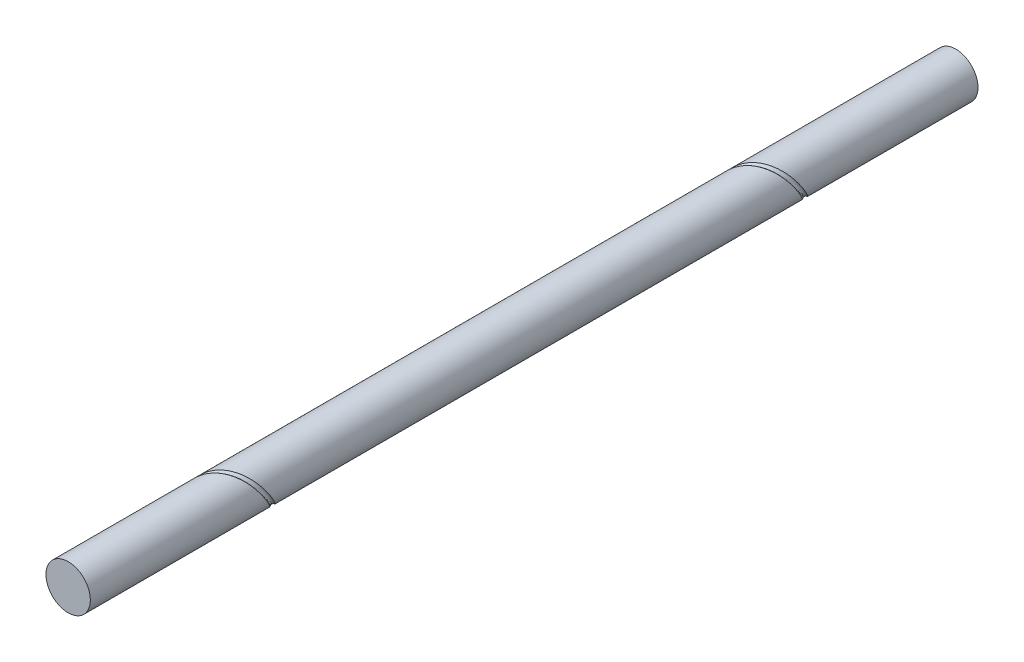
ISO-10303-21;
HEADER;
FILE_DESCRIPTION(('STEP AP214'),'2;1');
FILE_NAME('part.step','',(''),(''),'','','');
FILE_SCHEMA(('AUTOMOTIVE_DESIGN { 1 0 10303 214 1 1 1 1 }'));
ENDSEC;
DATA;
#1=APPLICATION_CONTEXT('core data for automotive mechanical design processes');
#2=APPLICATION_PROTOCOL_DEFINITION('international standard','automotive_design',2000,#1);
#3=PRODUCT_CONTEXT('',#1,'mechanical');
#4=PRODUCT('Part','Part','',(#3));
#5=PRODUCT_RELATED_PRODUCT_CATEGORY('part','',(#4));
#6=PRODUCT_DEFINITION_FORMATION('','',#4);
#7=PRODUCT_DEFINITION_CONTEXT('part definition',#1,'design');
#8=PRODUCT_DEFINITION('design','',#6,#7);
#9=PRODUCT_DEFINITION_SHAPE('','',#8);
#10=(LENGTH_UNIT() NAMED_UNIT(*) SI_UNIT(.MILLI.,.METRE.));
#11=(NAMED_UNIT(*) PLANE_ANGLE_UNIT() SI_UNIT($,.RADIAN.));
#12=(NAMED_UNIT(*) SI_UNIT($,.STERADIAN.) SOLID_ANGLE_UNIT());
#13=UNCERTAINTY_MEASURE_WITH_UNIT(LENGTH_MEASURE(1.E-05),#10,'distance_accuracy_value','');
#14=(GEOMETRIC_REPRESENTATION_CONTEXT(3) GLOBAL_UNCERTAINTY_ASSIGNED_CONTEXT((#13)) GLOBAL_UNIT_ASSIGNED_CONTEXT((#10,
#11,#12)) REPRESENTATION_CONTEXT('',''));
#15=CARTESIAN_POINT('',(0.,0.,0.));
#16=DIRECTION('',(0.,0.,1.));
#17=DIRECTION('',(1.,0.,0.));
#18=AXIS2_PLACEMENT_3D('',#15,#16,#17);
#19=CARTESIAN_POINT('',(0.,0.,1000.));
#20=DIRECTION('',(0.,0.,-1.));
#21=DIRECTION('',(-1.,0.,0.));
#22=AXIS2_PLACEMENT_3D('',#19,#20,#21);
#23=CYLINDRICAL_SURFACE('',#22,25.);
#24=CARTESIAN_POINT('',(-25.,0.,152.958317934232));
#25=CARTESIAN_POINT('',(-25.,-2.31659115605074,154.428906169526));
#26=CARTESIAN_POINT('',(-24.5743274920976,-4.59373794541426,155.89949440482));
#27=CARTESIAN_POINT('',(-24.1486549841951,-6.87088473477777,157.370082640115));
#28=CARTESIAN_POINT('',(-23.3118057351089,-9.03104165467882,158.840670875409));
#29=CARTESIAN_POINT('',(-22.4749564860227,-11.1911985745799,160.311259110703));
#30=CARTESIAN_POINT('',(-21.2554283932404,-13.1608040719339,161.781847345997));
#31=CARTESIAN_POINT('',(-20.035900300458,-15.1304095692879,163.252435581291));
#32=CARTESIAN_POINT('',(-18.4752229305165,-16.8423910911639,164.723023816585));
#33=CARTESIAN_POINT('',(-16.914545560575,-18.55437261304,166.193612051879));
#34=CARTESIAN_POINT('',(-15.0658659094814,-19.950430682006,167.664200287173));
#35=CARTESIAN_POINT('',(-13.2171862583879,-21.346488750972,169.134788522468));
#36=CARTESIAN_POINT('',(-11.1434588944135,-22.3790822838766,170.605376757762));
#37=CARTESIAN_POINT('',(-9.06973153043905,-23.4116758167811,172.075964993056));
#38=CARTESIAN_POINT('',(-6.84157475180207,-24.0456410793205,173.54655322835));
#39=CARTESIAN_POINT('',(-4.6134179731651,-24.6796063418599,175.017141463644));
#40=CARTESIAN_POINT('',(-2.30670898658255,-24.8933544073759,176.487729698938));
#41=CARTESIAN_POINT('',(0.,-25.1071024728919,177.958317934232));
#42=CARTESIAN_POINT('',(2.30670898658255,-24.8933544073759,179.428906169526));
#43=CARTESIAN_POINT('',(4.6134179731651,-24.6796063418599,180.89949440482));
#44=CARTESIAN_POINT('',(6.84157475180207,-24.0456410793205,182.370082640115));
#45=CARTESIAN_POINT('',(9.06973153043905,-23.4116758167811,183.840670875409));
#46=CARTESIAN_POINT('',(11.1434588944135,-22.3790822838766,185.311259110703));
#47=CARTESIAN_POINT('',(13.2171862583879,-21.346488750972,186.781847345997));
#48=CARTESIAN_POINT('',(15.0658659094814,-19.950430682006,188.252435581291));
#49=CARTESIAN_POINT('',(16.914545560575,-18.55437261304,189.723023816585));
#50=CARTESIAN_POINT('',(18.4752229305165,-16.8423910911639,191.193612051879));
#51=CARTESIAN_POINT('',(20.035900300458,-15.1304095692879,192.664200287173));
#52=CARTESIAN_POINT('',(21.2554283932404,-13.1608040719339,194.134788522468));
#53=CARTESIAN_POINT('',(22.4749564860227,-11.1911985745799,195.605376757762));
#54=CARTESIAN_POINT('',(23.3118057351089,-9.03104165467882,197.075964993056));
#55=CARTESIAN_POINT('',(24.1486549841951,-6.87088473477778,198.54655322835));
#56=CARTESIAN_POINT('',(24.5743274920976,-4.59373794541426,200.017141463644));
#57=CARTESIAN_POINT('',(25.,-2.31659115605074,201.487729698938));
#58=CARTESIAN_POINT('',(25.,0.,202.958317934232));
#59=CARTESIAN_POINT('',(25.,2.31659115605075,204.428906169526));
#60=CARTESIAN_POINT('',(24.5743274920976,4.59373794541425,205.89949440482));
#61=CARTESIAN_POINT('',(24.1486549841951,6.87088473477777,207.370082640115));
#62=CARTESIAN_POINT('',(23.3118057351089,9.03104165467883,208.840670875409));
#63=CARTESIAN_POINT('',(22.4749564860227,11.1911985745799,210.311259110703));
#64=CARTESIAN_POINT('',(21.2554283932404,13.1608040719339,211.781847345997));
#65=CARTESIAN_POINT('',(20.035900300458,15.1304095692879,213.252435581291));
#66=CARTESIAN_POINT('',(18.4752229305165,16.8423910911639,214.723023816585));
#67=CARTESIAN_POINT('',(16.914545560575,18.55437261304,216.193612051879));
#68=CARTESIAN_POINT('',(15.0658659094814,19.950430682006,217.664200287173));
#69=CARTESIAN_POINT('',(13.2171862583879,21.346488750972,219.134788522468));
#70=CARTESIAN_POINT('',(11.1434588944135,22.3790822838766,220.605376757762));
#71=CARTESIAN_POINT('',(9.06973153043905,23.4116758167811,222.075964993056));
#72=CARTESIAN_POINT('',(6.84157475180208,24.0456410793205,223.54655322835));
#73=CARTESIAN_POINT('',(4.61341797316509,24.6796063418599,225.017141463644));
#74=CARTESIAN_POINT('',(2.30670898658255,24.8933544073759,226.487729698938));
#75=CARTESIAN_POINT('',(0.,25.1071024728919,227.958317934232));
#76=CARTESIAN_POINT('',(-2.30670898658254,24.8933544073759,229.428906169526));
#77=CARTESIAN_POINT('',(-4.61341797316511,24.6796063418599,230.89949440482));
#78=CARTESIAN_POINT('',(-6.84157475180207,24.0456410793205,232.370082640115));
#79=CARTESIAN_POINT('',(-9.06973153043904,23.4116758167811,233.840670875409));
#80=CARTESIAN_POINT('',(-11.1434588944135,22.3790822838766,235.311259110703));
#81=CARTESIAN_POINT('',(-13.2171862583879,21.346488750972,236.781847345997));
#82=CARTESIAN_POINT('',(-15.0658659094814,19.950430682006,238.252435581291));
#83=CARTESIAN_POINT('',(-16.914545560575,18.5543726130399,239.723023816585));
#84=CARTESIAN_POINT('',(-18.4752229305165,16.8423910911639,241.193612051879));
#85=CARTESIAN_POINT('',(-20.035900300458,15.1304095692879,242.664200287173));
#86=CARTESIAN_POINT('',(-21.2554283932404,13.1608040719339,244.134788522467));
#87=CARTESIAN_POINT('',(-22.4749564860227,11.1911985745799,245.605376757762));
#88=CARTESIAN_POINT('',(-23.3118057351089,9.03104165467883,247.075964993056));
#89=CARTESIAN_POINT('',(-24.1486549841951,6.87088473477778,248.54655322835));
#90=CARTESIAN_POINT('',(-24.5743274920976,4.59373794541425,250.017141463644));
#91=CARTESIAN_POINT('',(-25.,2.31659115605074,251.487729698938));
#92=CARTESIAN_POINT('',(-25.,0.,252.958317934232));
#93=(BOUNDED_CURVE() B_SPLINE_CURVE(2,(#24,#25,#26,#27,#28,#29,#30,#31,#32,#33,#34,#35,#36,#37,
#38,#39,#40,#41,#42,#43,#44,#45,#46,#47,#48,#49,#50,#51,#52,#53,#54,#55,#56,#57,#58,#59,#60,#61,
#62,#63,#64,#65,#66,#67,#68,#69,#70,#71,#72,#73,#74,#75,#76,#77,#78,#79,#80,#81,#82,#83,#84,#85,
#86,#87,#88,#89,#90,#91,#92),.UNSPECIFIED.,.F.,.F.) B_SPLINE_CURVE_WITH_KNOTS((3,2,2,2,2,2,2,2,
2,2,2,2,2,2,2,2,2,2,2,2,2,2,2,2,2,2,2,2,2,2,2,2,2,2,3),(0.,0.0294117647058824,
0.0588235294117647,0.0882352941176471,0.117647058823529,0.147058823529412,0.176470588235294,
0.205882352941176,0.235294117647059,0.264705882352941,0.294117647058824,0.323529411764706,
0.352941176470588,0.382352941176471,0.411764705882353,0.441176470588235,0.470588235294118,0.5,
0.529411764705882,0.558823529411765,0.588235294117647,0.617647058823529,0.647058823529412,
0.676470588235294,0.705882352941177,0.735294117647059,0.764705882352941,0.794117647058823,
0.823529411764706,0.852941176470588,0.882352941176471,0.911764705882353,0.941176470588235,
0.970588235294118,1.),
.UNSPECIFIED.) CURVE() GEOMETRIC_REPRESENTATION_ITEM() RATIONAL_B_SPLINE_CURVE((0.6,
0.597440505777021,0.6,0.597440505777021,0.6,0.597440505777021,0.6,0.597440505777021,0.6,
0.597440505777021,0.6,0.597440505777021,0.6,0.597440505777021,0.6,0.597440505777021,0.6,
0.597440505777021,0.6,0.597440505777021,0.6,0.597440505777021,0.6,0.597440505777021,0.6,
0.597440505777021,0.6,0.597440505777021,0.6,0.597440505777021,0.6,0.597440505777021,0.6,
0.597440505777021,0.6,0.597440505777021,0.6,0.597440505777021,0.6,0.597440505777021,0.6,
0.597440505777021,0.6,0.597440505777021,0.6,0.597440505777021,0.6,0.597440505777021,0.6,
0.597440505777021,0.6,0.597440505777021,0.6,0.597440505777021,0.6,0.597440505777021,0.6,
0.597440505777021,0.6,0.597440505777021,0.6,0.597440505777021,0.6,0.597440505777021,0.6,
0.597440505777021,0.6,0.597440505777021,0.6)) REPRESENTATION_ITEM(''));
#94=CARTESIAN_POINT('',(-25.,0.,252.958317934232));
#95=VERTEX_POINT('',#94);
#96=CARTESIAN_POINT('',(-25.,0.,152.958317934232));
#97=VERTEX_POINT('',#96);
#98=EDGE_CURVE('E102',#95,#97,#93,.F.);
#99=ORIENTED_EDGE('',*,*,#98,.F.);
#100=DIRECTION('',(0.,0.,-1.));
#101=VECTOR('',#100,1.);
#102=CARTESIAN_POINT('',(-25.,0.,1000.));
#103=LINE('',#102,#101);
#104=CARTESIAN_POINT('',(-25.,0.,247.041682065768));
#105=VERTEX_POINT('',#104);
#106=EDGE_CURVE('E118',#95,#105,#103,.T.);
#107=ORIENTED_EDGE('',*,*,#106,.T.);
#108=CARTESIAN_POINT('',(-25.,0.,147.041682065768));
#109=CARTESIAN_POINT('',(-25.,-2.31659115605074,148.512270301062));
#110=CARTESIAN_POINT('',(-24.5743274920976,-4.59373794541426,149.982858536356));
#111=CARTESIAN_POINT('',(-24.1486549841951,-6.87088473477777,151.45344677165));
#112=CARTESIAN_POINT('',(-23.3118057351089,-9.03104165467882,152.924035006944));
#113=CARTESIAN_POINT('',(-22.4749564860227,-11.1911985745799,154.394623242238));
#114=CARTESIAN_POINT('',(-21.2554283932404,-13.1608040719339,155.865211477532));
#115=CARTESIAN_POINT('',(-20.035900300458,-15.1304095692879,157.335799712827));
#116=CARTESIAN_POINT('',(-18.4752229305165,-16.8423910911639,158.806387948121));
#117=CARTESIAN_POINT('',(-16.914545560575,-18.5543726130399,160.276976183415));
#118=CARTESIAN_POINT('',(-15.0658659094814,-19.950430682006,161.747564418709));
#119=CARTESIAN_POINT('',(-13.2171862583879,-21.346488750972,163.218152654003));
#120=CARTESIAN_POINT('',(-11.1434588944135,-22.3790822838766,164.688740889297));
#121=CARTESIAN_POINT('',(-9.06973153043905,-23.4116758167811,166.159329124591));
#122=CARTESIAN_POINT('',(-6.84157475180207,-24.0456410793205,167.629917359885));
#123=CARTESIAN_POINT('',(-4.6134179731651,-24.6796063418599,169.100505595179));
#124=CARTESIAN_POINT('',(-2.30670898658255,-24.8933544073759,170.571093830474));
#125=CARTESIAN_POINT('',(0.,-25.1071024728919,172.041682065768));
#126=CARTESIAN_POINT('',(2.30670898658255,-24.8933544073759,173.512270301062));
#127=CARTESIAN_POINT('',(4.6134179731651,-24.6796063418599,174.982858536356));
#128=CARTESIAN_POINT('',(6.84157475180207,-24.0456410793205,176.45344677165));
#129=CARTESIAN_POINT('',(9.06973153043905,-23.4116758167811,177.924035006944));
#130=CARTESIAN_POINT('',(11.1434588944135,-22.3790822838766,179.394623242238));
#131=CARTESIAN_POINT('',(13.2171862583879,-21.346488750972,180.865211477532));
#132=CARTESIAN_POINT('',(15.0658659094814,-19.950430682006,182.335799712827));
#133=CARTESIAN_POINT('',(16.914545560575,-18.5543726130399,183.806387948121));
#134=CARTESIAN_POINT('',(18.4752229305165,-16.8423910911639,185.276976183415));
#135=CARTESIAN_POINT('',(20.035900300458,-15.1304095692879,186.747564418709));
#136=CARTESIAN_POINT('',(21.2554283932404,-13.1608040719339,188.218152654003));
#137=CARTESIAN_POINT('',(22.4749564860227,-11.1911985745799,189.688740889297));
#138=CARTESIAN_POINT('',(23.3118057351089,-9.03104165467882,191.159329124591));
#139=CARTESIAN_POINT('',(24.1486549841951,-6.87088473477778,192.629917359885));
#140=CARTESIAN_POINT('',(24.5743274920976,-4.59373794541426,194.10050559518));
#141=CARTESIAN_POINT('',(25.,-2.31659115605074,195.571093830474));
#142=CARTESIAN_POINT('',(25.,0.,197.041682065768));
#143=CARTESIAN_POINT('',(25.,2.31659115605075,198.512270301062));
#144=CARTESIAN_POINT('',(24.5743274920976,4.59373794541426,199.982858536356));
#145=CARTESIAN_POINT('',(24.1486549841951,6.87088473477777,201.45344677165));
#146=CARTESIAN_POINT('',(23.3118057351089,9.03104165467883,202.924035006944));
#147=CARTESIAN_POINT('',(22.4749564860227,11.1911985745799,204.394623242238));
#148=CARTESIAN_POINT('',(21.2554283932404,13.1608040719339,205.865211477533));
#149=CARTESIAN_POINT('',(20.035900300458,15.1304095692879,207.335799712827));
#150=CARTESIAN_POINT('',(18.4752229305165,16.8423910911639,208.806387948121));
#151=CARTESIAN_POINT('',(16.914545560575,18.55437261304,210.276976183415));
#152=CARTESIAN_POINT('',(15.0658659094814,19.950430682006,211.747564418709));
#153=CARTESIAN_POINT('',(13.2171862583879,21.346488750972,213.218152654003));
#154=CARTESIAN_POINT('',(11.1434588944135,22.3790822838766,214.688740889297));
#155=CARTESIAN_POINT('',(9.06973153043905,23.4116758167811,216.159329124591));
#156=CARTESIAN_POINT('',(6.84157475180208,24.0456410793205,217.629917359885));
#157=CARTESIAN_POINT('',(4.61341797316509,24.6796063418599,219.10050559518));
#158=CARTESIAN_POINT('',(2.30670898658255,24.8933544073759,220.571093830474));
#159=CARTESIAN_POINT('',(0.,25.1071024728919,222.041682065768));
#160=CARTESIAN_POINT('',(-2.30670898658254,24.8933544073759,223.512270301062));
#161=CARTESIAN_POINT('',(-4.6134179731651,24.6796063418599,224.982858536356));
#162=CARTESIAN_POINT('',(-6.84157475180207,24.0456410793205,226.45344677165));
#163=CARTESIAN_POINT('',(-9.06973153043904,23.4116758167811,227.924035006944));
#164=CARTESIAN_POINT('',(-11.1434588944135,22.3790822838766,229.394623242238));
#165=CARTESIAN_POINT('',(-13.2171862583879,21.346488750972,230.865211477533));
#166=CARTESIAN_POINT('',(-15.0658659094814,19.950430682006,232.335799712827));
#167=CARTESIAN_POINT('',(-16.914545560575,18.5543726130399,233.806387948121));
#168=CARTESIAN_POINT('',(-18.4752229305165,16.8423910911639,235.276976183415));
#169=CARTESIAN_POINT('',(-20.035900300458,15.1304095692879,236.747564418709));
#170=CARTESIAN_POINT('',(-21.2554283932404,13.1608040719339,238.218152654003));
#171=CARTESIAN_POINT('',(-22.4749564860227,11.1911985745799,239.688740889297));
#172=CARTESIAN_POINT('',(-23.3118057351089,9.03104165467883,241.159329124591));
#173=CARTESIAN_POINT('',(-24.1486549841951,6.87088473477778,242.629917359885));
#174=CARTESIAN_POINT('',(-24.5743274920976,4.59373794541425,244.10050559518));
#175=CARTESIAN_POINT('',(-25.,2.31659115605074,245.571093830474));
#176=CARTESIAN_POINT('',(-25.,0.,247.041682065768));
#177=(BOUNDED_CURVE() B_SPLINE_CURVE(2,(#108,#109,#110,#111,#112,#113,#114,#115,#116,#117,#118,
#119,#120,#121,#122,#123,#124,#125,#126,#127,#128,#129,#130,#131,#132,#133,#134,#135,#136,#137,
#138,#139,#140,#141,#142,#143,#144,#145,#146,#147,#148,#149,#150,#151,#152,#153,#154,#155,#156,
#157,#158,#159,#160,#161,#162,#163,#164,#165,#166,#167,#168,#169,#170,#171,#172,#173,#174,#175,
#176),.UNSPECIFIED.,.F.,.F.) B_SPLINE_CURVE_WITH_KNOTS((3,2,2,2,2,2,2,2,2,2,2,2,2,2,2,2,2,2,2,2,
2,2,2,2,2,2,2,2,2,2,2,2,2,2,3),(0.,0.0294117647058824,0.0588235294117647,0.0882352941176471,
0.117647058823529,0.147058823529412,0.176470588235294,0.205882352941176,0.235294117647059,
0.264705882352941,0.294117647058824,0.323529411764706,0.352941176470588,0.382352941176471,
0.411764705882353,0.441176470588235,0.470588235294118,0.5,0.529411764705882,0.558823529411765,
0.588235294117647,0.617647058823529,0.647058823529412,0.676470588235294,0.705882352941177,
0.735294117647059,0.764705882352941,0.794117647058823,0.823529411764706,0.852941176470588,
0.882352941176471,0.911764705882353,0.941176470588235,0.970588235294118,1.),
.UNSPECIFIED.) CURVE() GEOMETRIC_REPRESENTATION_ITEM() RATIONAL_B_SPLINE_CURVE((0.6,
0.597440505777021,0.6,0.597440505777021,0.6,0.597440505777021,0.6,0.597440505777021,0.6,
0.597440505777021,0.6,0.597440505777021,0.6,0.597440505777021,0.6,0.597440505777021,0.6,
0.597440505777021,0.6,0.597440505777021,0.6,0.597440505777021,0.6,0.597440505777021,0.6,
0.597440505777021,0.6,0.597440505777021,0.6,0.597440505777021,0.6,0.597440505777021,0.6,
0.597440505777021,0.6,0.597440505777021,0.6,0.597440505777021,0.6,0.597440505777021,0.6,
0.597440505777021,0.6,0.597440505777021,0.6,0.597440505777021,0.6,0.597440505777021,0.6,
0.597440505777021,0.6,0.597440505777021,0.6,0.597440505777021,0.6,0.597440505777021,0.6,
0.597440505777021,0.6,0.597440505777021,0.6,0.597440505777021,0.6,0.597440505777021,0.6,
0.597440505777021,0.6,0.597440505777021,0.6)) REPRESENTATION_ITEM(''));
#178=CARTESIAN_POINT('',(-25.,0.,147.041682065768));
#179=VERTEX_POINT('',#178);
#180=EDGE_CURVE('E122',#105,#179,#177,.F.);
#181=ORIENTED_EDGE('',*,*,#180,.T.);
#182=DIRECTION('',(0.,0.,-1.));
#183=VECTOR('',#182,1.);
#184=CARTESIAN_POINT('',(-25.,0.,1000.));
#185=LINE('',#184,#183);
#186=EDGE_CURVE('E111',#97,#179,#185,.T.);
#187=ORIENTED_EDGE('',*,*,#186,.F.);
#188=EDGE_LOOP('',(#99,#107,#181,#187));
#189=FACE_BOUND('',#188,.T.);
#190=CARTESIAN_POINT('',(0.,0.,1000.));
#191=DIRECTION('',(0.,0.,1.));
#192=DIRECTION('',(1.,0.,0.));
#193=AXIS2_PLACEMENT_3D('',#190,#191,#192);
#194=CIRCLE('',#193,25.);
#195=CARTESIAN_POINT('',(25.,0.,1000.));
#196=VERTEX_POINT('',#195);
#197=EDGE_CURVE('E128',#196,#196,#194,.T.);
#198=ORIENTED_EDGE('',*,*,#197,.F.);
#199=EDGE_LOOP('',(#198));
#200=FACE_BOUND('',#199,.T.);
#201=CARTESIAN_POINT('',(0.,0.,0.));
#202=DIRECTION('',(0.,0.,1.));
#203=DIRECTION('',(1.,0.,0.));
#204=AXIS2_PLACEMENT_3D('',#201,#202,#203);
#205=CIRCLE('',#204,25.);
#206=CARTESIAN_POINT('',(25.,0.,0.));
#207=VERTEX_POINT('',#206);
#208=EDGE_CURVE('E129',#207,#207,#205,.T.);
#209=ORIENTED_EDGE('',*,*,#208,.T.);
#210=EDGE_LOOP('',(#209));
#211=FACE_BOUND('',#210,.T.);
#212=CARTESIAN_POINT('',(-25.,0.,752.958317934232));
#213=CARTESIAN_POINT('',(-25.,-2.31659115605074,754.428906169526));
#214=CARTESIAN_POINT('',(-24.5743274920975,-4.59373794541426,755.89949440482));
#215=CARTESIAN_POINT('',(-24.1486549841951,-6.87088473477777,757.370082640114));
#216=CARTESIAN_POINT('',(-23.3118057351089,-9.03104165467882,758.840670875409));
#217=CARTESIAN_POINT('',(-22.4749564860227,-11.1911985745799,760.311259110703));
#218=CARTESIAN_POINT('',(-21.2554283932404,-13.1608040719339,761.781847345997));
#219=CARTESIAN_POINT('',(-20.035900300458,-15.1304095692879,763.252435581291));
#220=CARTESIAN_POINT('',(-18.4752229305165,-16.8423910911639,764.723023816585));
#221=CARTESIAN_POINT('',(-16.9145455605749,-18.5543726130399,766.193612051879));
#222=CARTESIAN_POINT('',(-15.0658659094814,-19.950430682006,767.664200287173));
#223=CARTESIAN_POINT('',(-13.2171862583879,-21.346488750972,769.134788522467));
#224=CARTESIAN_POINT('',(-11.1434588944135,-22.3790822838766,770.605376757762));
#225=CARTESIAN_POINT('',(-9.06973153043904,-23.4116758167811,772.075964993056));
#226=CARTESIAN_POINT('',(-6.84157475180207,-24.0456410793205,773.54655322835));
#227=CARTESIAN_POINT('',(-4.6134179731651,-24.6796063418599,775.017141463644));
#228=CARTESIAN_POINT('',(-2.30670898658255,-24.8933544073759,776.487729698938));
#229=CARTESIAN_POINT('',(0.,-25.1071024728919,777.958317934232));
#230=CARTESIAN_POINT('',(2.30670898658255,-24.8933544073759,779.428906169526));
#231=CARTESIAN_POINT('',(4.6134179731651,-24.6796063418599,780.89949440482));
#232=CARTESIAN_POINT('',(6.84157475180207,-24.0456410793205,782.370082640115));
#233=CARTESIAN_POINT('',(9.06973153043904,-23.4116758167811,783.840670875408));
#234=CARTESIAN_POINT('',(11.1434588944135,-22.3790822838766,785.311259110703));
#235=CARTESIAN_POINT('',(13.2171862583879,-21.346488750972,786.781847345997));
#236=CARTESIAN_POINT('',(15.0658659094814,-19.950430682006,788.252435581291));
#237=CARTESIAN_POINT('',(16.9145455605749,-18.5543726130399,789.723023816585));
#238=CARTESIAN_POINT('',(18.4752229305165,-16.8423910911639,791.193612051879));
#239=CARTESIAN_POINT('',(20.035900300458,-15.1304095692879,792.664200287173));
#240=CARTESIAN_POINT('',(21.2554283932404,-13.1608040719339,794.134788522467));
#241=CARTESIAN_POINT('',(22.4749564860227,-11.1911985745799,795.605376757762));
#242=CARTESIAN_POINT('',(23.3118057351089,-9.03104165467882,797.075964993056));
#243=CARTESIAN_POINT('',(24.1486549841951,-6.87088473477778,798.54655322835));
#244=CARTESIAN_POINT('',(24.5743274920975,-4.59373794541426,800.017141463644));
#245=CARTESIAN_POINT('',(25.,-2.31659115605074,801.487729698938));
#246=CARTESIAN_POINT('',(25.,0.,802.958317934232));
#247=CARTESIAN_POINT('',(25.,2.31659115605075,804.428906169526));
#248=CARTESIAN_POINT('',(24.5743274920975,4.59373794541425,805.89949440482));
#249=CARTESIAN_POINT('',(24.1486549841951,6.87088473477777,807.370082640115));
#250=CARTESIAN_POINT('',(23.3118057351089,9.03104165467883,808.840670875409));
#251=CARTESIAN_POINT('',(22.4749564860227,11.1911985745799,810.311259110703));
#252=CARTESIAN_POINT('',(21.2554283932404,13.1608040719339,811.781847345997));
#253=CARTESIAN_POINT('',(20.035900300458,15.1304095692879,813.252435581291));
#254=CARTESIAN_POINT('',(18.4752229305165,16.8423910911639,814.723023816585));
#255=CARTESIAN_POINT('',(16.9145455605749,18.5543726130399,816.193612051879));
#256=CARTESIAN_POINT('',(15.0658659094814,19.950430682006,817.664200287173));
#257=CARTESIAN_POINT('',(13.2171862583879,21.346488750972,819.134788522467));
#258=CARTESIAN_POINT('',(11.1434588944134,22.3790822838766,820.605376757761));
#259=CARTESIAN_POINT('',(9.06973153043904,23.4116758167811,822.075964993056));
#260=CARTESIAN_POINT('',(6.84157475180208,24.0456410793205,823.54655322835));
#261=CARTESIAN_POINT('',(4.61341797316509,24.6796063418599,825.017141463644));
#262=CARTESIAN_POINT('',(2.30670898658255,24.8933544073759,826.487729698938));
#263=CARTESIAN_POINT('',(0.,25.1071024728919,827.958317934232));
#264=CARTESIAN_POINT('',(-2.30670898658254,24.8933544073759,829.428906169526));
#265=CARTESIAN_POINT('',(-4.6134179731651,24.6796063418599,830.89949440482));
#266=CARTESIAN_POINT('',(-6.84157475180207,24.0456410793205,832.370082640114));
#267=CARTESIAN_POINT('',(-9.06973153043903,23.4116758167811,833.840670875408));
#268=CARTESIAN_POINT('',(-11.1434588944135,22.3790822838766,835.311259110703));
#269=CARTESIAN_POINT('',(-13.2171862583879,21.346488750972,836.781847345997));
#270=CARTESIAN_POINT('',(-15.0658659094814,19.950430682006,838.252435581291));
#271=CARTESIAN_POINT('',(-16.9145455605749,18.5543726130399,839.723023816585));
#272=CARTESIAN_POINT('',(-18.4752229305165,16.8423910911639,841.193612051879));
#273=CARTESIAN_POINT('',(-20.035900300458,15.1304095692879,842.664200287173));
#274=CARTESIAN_POINT('',(-21.2554283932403,13.1608040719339,844.134788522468));
#275=CARTESIAN_POINT('',(-22.4749564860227,11.1911985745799,845.605376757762));
#276=CARTESIAN_POINT('',(-23.3118057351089,9.03104165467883,847.075964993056));
#277=CARTESIAN_POINT('',(-24.1486549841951,6.87088473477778,848.54655322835));
#278=CARTESIAN_POINT('',(-24.5743274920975,4.59373794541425,850.017141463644));
#279=CARTESIAN_POINT('',(-25.,2.31659115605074,851.487729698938));
#280=CARTESIAN_POINT('',(-25.,0.,852.958317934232));
#281=(BOUNDED_CURVE() B_SPLINE_CURVE(2,(#212,#213,#214,#215,#216,#217,#218,#219,#220,#221,#222,
#223,#224,#225,#226,#227,#228,#229,#230,#231,#232,#233,#234,#235,#236,#237,#238,#239,#240,#241,
#242,#243,#244,#245,#246,#247,#248,#249,#250,#251,#252,#253,#254,#255,#256,#257,#258,#259,#260,
#261,#262,#263,#264,#265,#266,#267,#268,#269,#270,#271,#272,#273,#274,#275,#276,#277,#278,#279,
#280),.UNSPECIFIED.,.F.,.F.) B_SPLINE_CURVE_WITH_KNOTS((3,2,2,2,2,2,2,2,2,2,2,2,2,2,2,2,2,2,2,2,
2,2,2,2,2,2,2,2,2,2,2,2,2,2,3),(0.,0.0294117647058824,0.0588235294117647,0.0882352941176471,
0.117647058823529,0.147058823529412,0.176470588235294,0.205882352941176,0.235294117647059,
0.264705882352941,0.294117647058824,0.323529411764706,0.352941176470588,0.382352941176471,
0.411764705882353,0.441176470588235,0.470588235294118,0.5,0.529411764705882,0.558823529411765,
0.588235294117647,0.617647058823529,0.647058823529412,0.676470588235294,0.705882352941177,
0.735294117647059,0.764705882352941,0.794117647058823,0.823529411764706,0.852941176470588,
0.882352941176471,0.911764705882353,0.941176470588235,0.970588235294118,1.),
.UNSPECIFIED.) CURVE() GEOMETRIC_REPRESENTATION_ITEM() RATIONAL_B_SPLINE_CURVE((0.6,
0.59744050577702,0.6,0.59744050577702,0.6,0.59744050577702,0.6,0.59744050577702,0.6,
0.59744050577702,0.6,0.59744050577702,0.6,0.59744050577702,0.6,0.59744050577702,0.6,
0.59744050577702,0.6,0.59744050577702,0.6,0.59744050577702,0.6,0.59744050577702,0.6,
0.59744050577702,0.6,0.59744050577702,0.6,0.59744050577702,0.6,0.59744050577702,0.6,
0.59744050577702,0.6,0.59744050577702,0.6,0.59744050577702,0.6,0.59744050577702,0.6,
0.59744050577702,0.6,0.59744050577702,0.6,0.59744050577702,0.6,0.59744050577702,0.6,
0.59744050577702,0.6,0.59744050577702,0.6,0.59744050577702,0.6,0.59744050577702,0.6,
0.59744050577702,0.6,0.59744050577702,0.6,0.59744050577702,0.6,0.59744050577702,0.6,
0.59744050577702,0.6,0.59744050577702,0.6)) REPRESENTATION_ITEM(''));
#282=CARTESIAN_POINT('',(-25.,0.,852.958317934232));
#283=VERTEX_POINT('',#282);
#284=CARTESIAN_POINT('',(-24.9999999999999,0.,752.958317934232));
#285=VERTEX_POINT('',#284);
#286=EDGE_CURVE('E11',#283,#285,#281,.F.);
#287=ORIENTED_EDGE('',*,*,#286,.F.);
#288=DIRECTION('',(0.,0.,-1.));
#289=VECTOR('',#288,1.);
#290=CARTESIAN_POINT('',(-25.,0.,1000.));
#291=LINE('',#290,#289);
#292=CARTESIAN_POINT('',(-25.0000000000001,0.,847.041682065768));
#293=VERTEX_POINT('',#292);
#294=EDGE_CURVE('E93',#283,#293,#291,.T.);
#295=ORIENTED_EDGE('',*,*,#294,.T.);
#296=CARTESIAN_POINT('',(-25.,0.,747.041682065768));
#297=CARTESIAN_POINT('',(-25.,-2.31659115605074,748.512270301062));
#298=CARTESIAN_POINT('',(-24.5743274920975,-4.59373794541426,749.982858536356));
#299=CARTESIAN_POINT('',(-24.1486549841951,-6.87088473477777,751.45344677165));
#300=CARTESIAN_POINT('',(-23.3118057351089,-9.03104165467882,752.924035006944));
#301=CARTESIAN_POINT('',(-22.4749564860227,-11.1911985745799,754.394623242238));
#302=CARTESIAN_POINT('',(-21.2554283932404,-13.1608040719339,755.865211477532));
#303=CARTESIAN_POINT('',(-20.035900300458,-15.1304095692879,757.335799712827));
#304=CARTESIAN_POINT('',(-18.4752229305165,-16.8423910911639,758.806387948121));
#305=CARTESIAN_POINT('',(-16.9145455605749,-18.5543726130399,760.276976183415));
#306=CARTESIAN_POINT('',(-15.0658659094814,-19.950430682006,761.747564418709));
#307=CARTESIAN_POINT('',(-13.2171862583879,-21.346488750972,763.218152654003));
#308=CARTESIAN_POINT('',(-11.1434588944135,-22.3790822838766,764.688740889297));
#309=CARTESIAN_POINT('',(-9.06973153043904,-23.4116758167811,766.159329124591));
#310=CARTESIAN_POINT('',(-6.84157475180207,-24.0456410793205,767.629917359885));
#311=CARTESIAN_POINT('',(-4.6134179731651,-24.6796063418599,769.100505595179));
#312=CARTESIAN_POINT('',(-2.30670898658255,-24.8933544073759,770.571093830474));
#313=CARTESIAN_POINT('',(0.,-25.1071024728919,772.041682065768));
#314=CARTESIAN_POINT('',(2.30670898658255,-24.8933544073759,773.512270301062));
#315=CARTESIAN_POINT('',(4.6134179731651,-24.6796063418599,774.982858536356));
#316=CARTESIAN_POINT('',(6.84157475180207,-24.0456410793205,776.45344677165));
#317=CARTESIAN_POINT('',(9.06973153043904,-23.4116758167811,777.924035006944));
#318=CARTESIAN_POINT('',(11.1434588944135,-22.3790822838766,779.394623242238));
#319=CARTESIAN_POINT('',(13.2171862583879,-21.346488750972,780.865211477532));
#320=CARTESIAN_POINT('',(15.0658659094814,-19.950430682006,782.335799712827));
#321=CARTESIAN_POINT('',(16.9145455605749,-18.5543726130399,783.806387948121));
#322=CARTESIAN_POINT('',(18.4752229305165,-16.8423910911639,785.276976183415));
#323=CARTESIAN_POINT('',(20.035900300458,-15.1304095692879,786.747564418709));
#324=CARTESIAN_POINT('',(21.2554283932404,-13.1608040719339,788.218152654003));
#325=CARTESIAN_POINT('',(22.4749564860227,-11.1911985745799,789.688740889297));
#326=CARTESIAN_POINT('',(23.3118057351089,-9.03104165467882,791.159329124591));
#327=CARTESIAN_POINT('',(24.1486549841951,-6.87088473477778,792.629917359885));
#328=CARTESIAN_POINT('',(24.5743274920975,-4.59373794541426,794.100505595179));
#329=CARTESIAN_POINT('',(25.,-2.31659115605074,795.571093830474));
#330=CARTESIAN_POINT('',(25.,0.,797.041682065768));
#331=CARTESIAN_POINT('',(25.,2.31659115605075,798.512270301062));
#332=CARTESIAN_POINT('',(24.5743274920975,4.59373794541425,799.982858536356));
#333=CARTESIAN_POINT('',(24.1486549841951,6.87088473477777,801.45344677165));
#334=CARTESIAN_POINT('',(23.3118057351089,9.03104165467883,802.924035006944));
#335=CARTESIAN_POINT('',(22.4749564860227,11.1911985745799,804.394623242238));
#336=CARTESIAN_POINT('',(21.2554283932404,13.1608040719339,805.865211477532));
#337=CARTESIAN_POINT('',(20.035900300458,15.1304095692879,807.335799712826));
#338=CARTESIAN_POINT('',(18.4752229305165,16.8423910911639,808.806387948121));
#339=CARTESIAN_POINT('',(16.9145455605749,18.5543726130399,810.276976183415));
#340=CARTESIAN_POINT('',(15.0658659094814,19.950430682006,811.747564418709));
#341=CARTESIAN_POINT('',(13.2171862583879,21.346488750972,813.218152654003));
#342=CARTESIAN_POINT('',(11.1434588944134,22.3790822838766,814.688740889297));
#343=CARTESIAN_POINT('',(9.06973153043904,23.4116758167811,816.159329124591));
#344=CARTESIAN_POINT('',(6.84157475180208,24.0456410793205,817.629917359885));
#345=CARTESIAN_POINT('',(4.61341797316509,24.6796063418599,819.100505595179));
#346=CARTESIAN_POINT('',(2.30670898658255,24.8933544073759,820.571093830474));
#347=CARTESIAN_POINT('',(0.,25.1071024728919,822.041682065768));
#348=CARTESIAN_POINT('',(-2.30670898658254,24.8933544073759,823.512270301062));
#349=CARTESIAN_POINT('',(-4.6134179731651,24.6796063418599,824.982858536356));
#350=CARTESIAN_POINT('',(-6.84157475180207,24.0456410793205,826.45344677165));
#351=CARTESIAN_POINT('',(-9.06973153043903,23.4116758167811,827.924035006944));
#352=CARTESIAN_POINT('',(-11.1434588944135,22.3790822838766,829.394623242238));
#353=CARTESIAN_POINT('',(-13.2171862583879,21.346488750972,830.865211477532));
#354=CARTESIAN_POINT('',(-15.0658659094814,19.950430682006,832.335799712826));
#355=CARTESIAN_POINT('',(-16.9145455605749,18.5543726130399,833.806387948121));
#356=CARTESIAN_POINT('',(-18.4752229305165,16.8423910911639,835.276976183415));
#357=CARTESIAN_POINT('',(-20.035900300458,15.1304095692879,836.747564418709));
#358=CARTESIAN_POINT('',(-21.2554283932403,13.1608040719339,838.218152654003));
#359=CARTESIAN_POINT('',(-22.4749564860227,11.1911985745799,839.688740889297));
#360=CARTESIAN_POINT('',(-23.3118057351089,9.03104165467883,841.159329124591));
#361=CARTESIAN_POINT('',(-24.1486549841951,6.87088473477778,842.629917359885));
#362=CARTESIAN_POINT('',(-24.5743274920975,4.59373794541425,844.100505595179));
#363=CARTESIAN_POINT('',(-25.,2.31659115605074,845.571093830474));
#364=CARTESIAN_POINT('',(-25.,0.,847.041682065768));
#365=(BOUNDED_CURVE() B_SPLINE_CURVE(2,(#296,#297,#298,#299,#300,#301,#302,#303,#304,#305,#306,
#307,#308,#309,#310,#311,#312,#313,#314,#315,#316,#317,#318,#319,#320,#321,#322,#323,#324,#325,
#326,#327,#328,#329,#330,#331,#332,#333,#334,#335,#336,#337,#338,#339,#340,#341,#342,#343,#344,
#345,#346,#347,#348,#349,#350,#351,#352,#353,#354,#355,#356,#357,#358,#359,#360,#361,#362,#363,
#364),.UNSPECIFIED.,.F.,.F.) B_SPLINE_CURVE_WITH_KNOTS((3,2,2,2,2,2,2,2,2,2,2,2,2,2,2,2,2,2,2,2,
2,2,2,2,2,2,2,2,2,2,2,2,2,2,3),(0.,0.0294117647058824,0.0588235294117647,0.0882352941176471,
0.117647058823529,0.147058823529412,0.176470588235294,0.205882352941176,0.235294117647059,
0.264705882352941,0.294117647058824,0.323529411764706,0.352941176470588,0.382352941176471,
0.411764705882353,0.441176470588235,0.470588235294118,0.5,0.529411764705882,0.558823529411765,
0.588235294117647,0.617647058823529,0.647058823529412,0.676470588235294,0.705882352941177,
0.735294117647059,0.764705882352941,0.794117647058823,0.823529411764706,0.852941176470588,
0.882352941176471,0.911764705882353,0.941176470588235,0.970588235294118,1.),
.UNSPECIFIED.) CURVE() GEOMETRIC_REPRESENTATION_ITEM() RATIONAL_B_SPLINE_CURVE((0.6,
0.59744050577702,0.6,0.59744050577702,0.6,0.59744050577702,0.6,0.59744050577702,0.6,
0.59744050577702,0.6,0.59744050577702,0.6,0.59744050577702,0.6,0.59744050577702,0.6,
0.59744050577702,0.6,0.59744050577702,0.6,0.59744050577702,0.6,0.59744050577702,0.6,
0.59744050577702,0.6,0.59744050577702,0.6,0.59744050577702,0.6,0.59744050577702,0.6,
0.59744050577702,0.6,0.59744050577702,0.6,0.59744050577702,0.6,0.59744050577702,0.6,
0.59744050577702,0.6,0.59744050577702,0.6,0.59744050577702,0.6,0.59744050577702,0.6,
0.59744050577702,0.6,0.59744050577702,0.6,0.59744050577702,0.6,0.59744050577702,0.6,
0.59744050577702,0.6,0.59744050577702,0.6,0.59744050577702,0.6,0.59744050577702,0.6,
0.59744050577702,0.6,0.59744050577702,0.6)) REPRESENTATION_ITEM(''));
#366=CARTESIAN_POINT('',(-25.,0.,747.041682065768));
#367=VERTEX_POINT('',#366);
#368=EDGE_CURVE('E91',#293,#367,#365,.F.);
#369=ORIENTED_EDGE('',*,*,#368,.T.);
#370=DIRECTION('',(0.,0.,-1.));
#371=VECTOR('',#370,1.);
#372=CARTESIAN_POINT('',(-25.,0.,1000.));
#373=LINE('',#372,#371);
#374=EDGE_CURVE('E49',#285,#367,#373,.T.);
#375=ORIENTED_EDGE('',*,*,#374,.F.);
#376=EDGE_LOOP('',(#287,#295,#369,#375));
#377=FACE_BOUND('',#376,.T.);
#378=ADVANCED_FACE('F39',(#189,#200,#211,#377),#23,.T.);
#379=CARTESIAN_POINT('',(0.,0.,1000.));
#380=DIRECTION('',(0.,0.,1.));
#381=DIRECTION('',(1.,0.,0.));
#382=AXIS2_PLACEMENT_3D('',#379,#380,#381);
#383=PLANE('',#382);
#384=ORIENTED_EDGE('',*,*,#197,.T.);
#385=EDGE_LOOP('',(#384));
#386=FACE_BOUND('',#385,.T.);
#387=ADVANCED_FACE('F164',(#386),#383,.T.);
#388=CARTESIAN_POINT('',(0.,0.,0.));
#389=DIRECTION('',(0.,0.,1.));
#390=DIRECTION('',(1.,0.,0.));
#391=AXIS2_PLACEMENT_3D('',#388,#389,#390);
#392=PLANE('',#391);
#393=ORIENTED_EDGE('',*,*,#208,.F.);
#394=EDGE_LOOP('',(#393));
#395=FACE_BOUND('',#394,.T.);
#396=ADVANCED_FACE('F157',(#395),#392,.F.);
#397=CARTESIAN_POINT('',(-27.646,0.,146.031));
#398=DIRECTION('',(0.,-1.,0.));
#399=DIRECTION('',(0.,0.,-1.));
#400=AXIS2_PLACEMENT_3D('',#397,#398,#399);
#401=PLANE('',#400);
#402=ORIENTED_EDGE('',*,*,#186,.T.);
#403=CARTESIAN_POINT('',(-27.646,0.,150.));
#404=DIRECTION('',(0.,1.,0.));
#405=DIRECTION('',(0.,0.,1.));
#406=AXIS2_PLACEMENT_3D('',#403,#404,#405);
#407=CIRCLE('',#406,3.969);
#408=EDGE_CURVE('E63',#97,#179,#407,.T.);
#409=ORIENTED_EDGE('',*,*,#408,.F.);
#410=EDGE_LOOP('',(#402,#409));
#411=FACE_BOUND('',#410,.T.);
#412=ADVANCED_FACE('F154',(#411),#401,.T.);
#413=CARTESIAN_POINT('',(-27.646,0.,246.031));
#414=DIRECTION('',(0.,-1.,0.));
#415=DIRECTION('',(0.,0.,-1.));
#416=AXIS2_PLACEMENT_3D('',#413,#414,#415);
#417=PLANE('',#416);
#418=CARTESIAN_POINT('',(-27.646,0.,250.));
#419=DIRECTION('',(0.,-1.,0.));
#420=DIRECTION('',(0.,0.,1.));
#421=AXIS2_PLACEMENT_3D('',#418,#419,#420);
#422=CIRCLE('',#421,3.969);
#423=EDGE_CURVE('E137',#105,#95,#422,.T.);
#424=ORIENTED_EDGE('',*,*,#423,.F.);
#425=ORIENTED_EDGE('',*,*,#106,.F.);
#426=EDGE_LOOP('',(#424,#425));
#427=FACE_BOUND('',#426,.T.);
#428=ADVANCED_FACE('F156',(#427),#417,.F.);
#429=CARTESIAN_POINT('',(-27.646,0.,153.969));
#430=CARTESIAN_POINT('',(-27.646,-2.56177916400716,155.439588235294));
#431=CARTESIAN_POINT('',(-27.1752743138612,-5.0799391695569,156.910176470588));
#432=CARTESIAN_POINT('',(-26.7045486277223,-7.59809917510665,158.380764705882));
#433=CARTESIAN_POINT('',(-25.7791272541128,-9.98688710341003,159.851352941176));
#434=CARTESIAN_POINT('',(-24.8537058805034,-12.3756750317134,161.321941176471));
#435=CARTESIAN_POINT('',(-23.5051029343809,-14.5537435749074,162.792529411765));
#436=CARTESIAN_POINT('',(-22.1564999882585,-16.7318121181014,164.263117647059));
#437=CARTESIAN_POINT('',(-20.4306405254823,-18.6249897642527,165.733705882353));
#438=CARTESIAN_POINT('',(-18.7047810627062,-20.5181674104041,167.204294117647));
#439=CARTESIAN_POINT('',(-16.6604371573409,-22.0619842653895,168.674882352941));
#440=CARTESIAN_POINT('',(-14.6160932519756,-23.6058011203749,170.145470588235));
#441=CARTESIAN_POINT('',(-12.3228825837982,-24.7476843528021,171.616058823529));
#442=CARTESIAN_POINT('',(-10.0296719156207,-25.8895675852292,173.086647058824));
#443=CARTESIAN_POINT('',(-7.5656870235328,-26.5906317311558,174.557235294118));
#444=CARTESIAN_POINT('',(-5.10170213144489,-27.2916958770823,176.027823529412));
#445=CARTESIAN_POINT('',(-2.55085106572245,-27.5280670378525,177.498411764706));
#446=CARTESIAN_POINT('',(0.,-27.7644381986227,178.969));
#447=CARTESIAN_POINT('',(2.55085106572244,-27.5280670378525,180.439588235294));
#448=CARTESIAN_POINT('',(5.1017021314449,-27.2916958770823,181.910176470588));
#449=CARTESIAN_POINT('',(7.5656870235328,-26.5906317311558,183.380764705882));
#450=CARTESIAN_POINT('',(10.0296719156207,-25.8895675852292,184.851352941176));
#451=CARTESIAN_POINT('',(12.3228825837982,-24.7476843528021,186.321941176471));
#452=CARTESIAN_POINT('',(14.6160932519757,-23.6058011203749,187.792529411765));
#453=CARTESIAN_POINT('',(16.6604371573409,-22.0619842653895,189.263117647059));
#454=CARTESIAN_POINT('',(18.7047810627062,-20.5181674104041,190.733705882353));
#455=CARTESIAN_POINT('',(20.4306405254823,-18.6249897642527,192.204294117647));
#456=CARTESIAN_POINT('',(22.1564999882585,-16.7318121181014,193.674882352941));
#457=CARTESIAN_POINT('',(23.5051029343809,-14.5537435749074,195.145470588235));
#458=CARTESIAN_POINT('',(24.8537058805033,-12.3756750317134,196.616058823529));
#459=CARTESIAN_POINT('',(25.7791272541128,-9.98688710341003,198.086647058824));
#460=CARTESIAN_POINT('',(26.7045486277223,-7.59809917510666,199.557235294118));
#461=CARTESIAN_POINT('',(27.1752743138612,-5.0799391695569,201.027823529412));
#462=CARTESIAN_POINT('',(27.646,-2.56177916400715,202.498411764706));
#463=CARTESIAN_POINT('',(27.646,0.,203.969));
#464=CARTESIAN_POINT('',(27.646,2.56177916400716,205.439588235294));
#465=CARTESIAN_POINT('',(27.1752743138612,5.0799391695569,206.910176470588));
#466=CARTESIAN_POINT('',(26.7045486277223,7.59809917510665,208.380764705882));
#467=CARTESIAN_POINT('',(25.7791272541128,9.98688710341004,209.851352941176));
#468=CARTESIAN_POINT('',(24.8537058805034,12.3756750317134,211.321941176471));
#469=CARTESIAN_POINT('',(23.5051029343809,14.5537435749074,212.792529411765));
#470=CARTESIAN_POINT('',(22.1564999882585,16.7318121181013,214.263117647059));
#471=CARTESIAN_POINT('',(20.4306405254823,18.6249897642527,215.733705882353));
#472=CARTESIAN_POINT('',(18.7047810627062,20.5181674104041,217.204294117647));
#473=CARTESIAN_POINT('',(16.6604371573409,22.0619842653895,218.674882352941));
#474=CARTESIAN_POINT('',(14.6160932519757,23.6058011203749,220.145470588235));
#475=CARTESIAN_POINT('',(12.3228825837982,24.7476843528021,221.616058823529));
#476=CARTESIAN_POINT('',(10.0296719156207,25.8895675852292,223.086647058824));
#477=CARTESIAN_POINT('',(7.56568702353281,26.5906317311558,224.557235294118));
#478=CARTESIAN_POINT('',(5.10170213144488,27.2916958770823,226.027823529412));
#479=CARTESIAN_POINT('',(2.55085106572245,27.5280670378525,227.498411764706));
#480=CARTESIAN_POINT('',(0.,27.7644381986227,228.969));
#481=CARTESIAN_POINT('',(-2.55085106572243,27.5280670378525,230.439588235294));
#482=CARTESIAN_POINT('',(-5.1017021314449,27.2916958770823,231.910176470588));
#483=CARTESIAN_POINT('',(-7.5656870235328,26.5906317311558,233.380764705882));
#484=CARTESIAN_POINT('',(-10.0296719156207,25.8895675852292,234.851352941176));
#485=CARTESIAN_POINT('',(-12.3228825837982,24.7476843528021,236.321941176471));
#486=CARTESIAN_POINT('',(-14.6160932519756,23.6058011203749,237.792529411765));
#487=CARTESIAN_POINT('',(-16.6604371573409,22.0619842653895,239.263117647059));
#488=CARTESIAN_POINT('',(-18.7047810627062,20.5181674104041,240.733705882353));
#489=CARTESIAN_POINT('',(-20.4306405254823,18.6249897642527,242.204294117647));
#490=CARTESIAN_POINT('',(-22.1564999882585,16.7318121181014,243.674882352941));
#491=CARTESIAN_POINT('',(-23.5051029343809,14.5537435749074,245.145470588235));
#492=CARTESIAN_POINT('',(-24.8537058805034,12.3756750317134,246.616058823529));
#493=CARTESIAN_POINT('',(-25.7791272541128,9.98688710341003,248.086647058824));
#494=CARTESIAN_POINT('',(-26.7045486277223,7.59809917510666,249.557235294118));
#495=CARTESIAN_POINT('',(-27.1752743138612,5.0799391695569,251.027823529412));
#496=CARTESIAN_POINT('',(-27.646,2.56177916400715,252.498411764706));
#497=CARTESIAN_POINT('',(-27.646,0.,253.969));
#498=CARTESIAN_POINT('',(-19.708,0.,153.969));
#499=CARTESIAN_POINT('',(-19.708,-1.82621514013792,155.439588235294));
#500=CARTESIAN_POINT('',(-19.3724338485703,-3.62133549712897,156.910176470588));
#501=CARTESIAN_POINT('',(-19.0368676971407,-5.41645585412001,158.380764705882));
#502=CARTESIAN_POINT('',(-18.377162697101,-7.11935075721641,159.851352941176));
#503=CARTESIAN_POINT('',(-17.7174576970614,-8.82224566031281,161.321941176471));
#504=CARTESIAN_POINT('',(-16.7560793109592,-10.3749250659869,162.792529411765));
#505=CARTESIAN_POINT('',(-15.7947009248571,-11.9276044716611,164.263117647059));
#506=CARTESIAN_POINT('',(-14.5643877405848,-13.2771937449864,165.733705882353));
#507=CARTESIAN_POINT('',(-13.3340745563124,-14.6267830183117,167.204294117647));
#508=CARTESIAN_POINT('',(-11.8767234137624,-15.727323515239,168.674882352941));
#509=CARTESIAN_POINT('',(-10.4193722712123,-16.8278640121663,170.145470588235));
#510=CARTESIAN_POINT('',(-8.78461151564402,-17.6418781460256,171.616058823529));
#511=CARTESIAN_POINT('',(-7.14985076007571,-18.4558922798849,173.086647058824));
#512=CARTESIAN_POINT('',(-5.39335020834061,-18.9556597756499,174.557235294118));
#513=CARTESIAN_POINT('',(-3.63684965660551,-19.455427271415,176.027823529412));
#514=CARTESIAN_POINT('',(-1.81842482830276,-19.6239291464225,177.498411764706));
#515=CARTESIAN_POINT('',(0.,-19.7924310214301,178.969));
#516=CARTESIAN_POINT('',(1.81842482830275,-19.6239291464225,180.439588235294));
#517=CARTESIAN_POINT('',(3.63684965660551,-19.455427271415,181.910176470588));
#518=CARTESIAN_POINT('',(5.39335020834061,-18.9556597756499,183.380764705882));
#519=CARTESIAN_POINT('',(7.14985076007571,-18.4558922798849,184.851352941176));
#520=CARTESIAN_POINT('',(8.78461151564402,-17.6418781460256,186.321941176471));
#521=CARTESIAN_POINT('',(10.4193722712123,-16.8278640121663,187.792529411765));
#522=CARTESIAN_POINT('',(11.8767234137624,-15.727323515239,189.263117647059));
#523=CARTESIAN_POINT('',(13.3340745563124,-14.6267830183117,190.733705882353));
#524=CARTESIAN_POINT('',(14.5643877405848,-13.2771937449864,192.204294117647));
#525=CARTESIAN_POINT('',(15.7947009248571,-11.9276044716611,193.674882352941));
#526=CARTESIAN_POINT('',(16.7560793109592,-10.3749250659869,195.145470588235));
#527=CARTESIAN_POINT('',(17.7174576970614,-8.82224566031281,196.616058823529));
#528=CARTESIAN_POINT('',(18.377162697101,-7.11935075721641,198.086647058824));
#529=CARTESIAN_POINT('',(19.0368676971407,-5.41645585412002,199.557235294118));
#530=CARTESIAN_POINT('',(19.3724338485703,-3.62133549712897,201.027823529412));
#531=CARTESIAN_POINT('',(19.708,-1.82621514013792,202.498411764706));
#532=CARTESIAN_POINT('',(19.708,0.,203.969));
#533=CARTESIAN_POINT('',(19.708,1.82621514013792,205.439588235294));
#534=CARTESIAN_POINT('',(19.3724338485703,3.62133549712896,206.910176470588));
#535=CARTESIAN_POINT('',(19.0368676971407,5.41645585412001,208.380764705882));
#536=CARTESIAN_POINT('',(18.377162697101,7.11935075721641,209.851352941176));
#537=CARTESIAN_POINT('',(17.7174576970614,8.82224566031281,211.321941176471));
#538=CARTESIAN_POINT('',(16.7560793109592,10.3749250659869,212.792529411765));
#539=CARTESIAN_POINT('',(15.7947009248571,11.927604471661,214.263117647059));
#540=CARTESIAN_POINT('',(14.5643877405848,13.2771937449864,215.733705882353));
#541=CARTESIAN_POINT('',(13.3340745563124,14.6267830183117,217.204294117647));
#542=CARTESIAN_POINT('',(11.8767234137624,15.727323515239,218.674882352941));
#543=CARTESIAN_POINT('',(10.4193722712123,16.8278640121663,220.145470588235));
#544=CARTESIAN_POINT('',(8.78461151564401,17.6418781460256,221.616058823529));
#545=CARTESIAN_POINT('',(7.14985076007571,18.4558922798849,223.086647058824));
#546=CARTESIAN_POINT('',(5.39335020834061,18.9556597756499,224.557235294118));
#547=CARTESIAN_POINT('',(3.63684965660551,19.455427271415,226.027823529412));
#548=CARTESIAN_POINT('',(1.81842482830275,19.6239291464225,227.498411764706));
#549=CARTESIAN_POINT('',(0.,19.7924310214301,228.969));
#550=CARTESIAN_POINT('',(-1.81842482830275,19.6239291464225,230.439588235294));
#551=CARTESIAN_POINT('',(-3.63684965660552,19.455427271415,231.910176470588));
#552=CARTESIAN_POINT('',(-5.39335020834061,18.9556597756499,233.380764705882));
#553=CARTESIAN_POINT('',(-7.1498507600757,18.4558922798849,234.851352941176));
#554=CARTESIAN_POINT('',(-8.78461151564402,17.6418781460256,236.321941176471));
#555=CARTESIAN_POINT('',(-10.4193722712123,16.8278640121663,237.792529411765));
#556=CARTESIAN_POINT('',(-11.8767234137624,15.727323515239,239.263117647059));
#557=CARTESIAN_POINT('',(-13.3340745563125,14.6267830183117,240.733705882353));
#558=CARTESIAN_POINT('',(-14.5643877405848,13.2771937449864,242.204294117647));
#559=CARTESIAN_POINT('',(-15.7947009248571,11.9276044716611,243.674882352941));
#560=CARTESIAN_POINT('',(-16.7560793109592,10.3749250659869,245.145470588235));
#561=CARTESIAN_POINT('',(-17.7174576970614,8.82224566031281,246.616058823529));
#562=CARTESIAN_POINT('',(-18.377162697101,7.11935075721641,248.086647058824));
#563=CARTESIAN_POINT('',(-19.0368676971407,5.41645585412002,249.557235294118));
#564=CARTESIAN_POINT('',(-19.3724338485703,3.62133549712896,251.027823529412));
#565=CARTESIAN_POINT('',(-19.708,1.82621514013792,252.498411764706));
#566=CARTESIAN_POINT('',(-19.708,0.,253.969));
#567=CARTESIAN_POINT('',(-19.708,0.,146.031));
#568=CARTESIAN_POINT('',(-19.708,-1.82621514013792,147.501588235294));
#569=CARTESIAN_POINT('',(-19.3724338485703,-3.62133549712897,148.972176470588));
#570=CARTESIAN_POINT('',(-19.0368676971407,-5.41645585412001,150.442764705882));
#571=CARTESIAN_POINT('',(-18.377162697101,-7.11935075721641,151.913352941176));
#572=CARTESIAN_POINT('',(-17.7174576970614,-8.82224566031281,153.383941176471));
#573=CARTESIAN_POINT('',(-16.7560793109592,-10.3749250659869,154.854529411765));
#574=CARTESIAN_POINT('',(-15.7947009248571,-11.9276044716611,156.325117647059));
#575=CARTESIAN_POINT('',(-14.5643877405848,-13.2771937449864,157.795705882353));
#576=CARTESIAN_POINT('',(-13.3340745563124,-14.6267830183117,159.266294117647));
#577=CARTESIAN_POINT('',(-11.8767234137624,-15.727323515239,160.736882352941));
#578=CARTESIAN_POINT('',(-10.4193722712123,-16.8278640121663,162.207470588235));
#579=CARTESIAN_POINT('',(-8.78461151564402,-17.6418781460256,163.678058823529));
#580=CARTESIAN_POINT('',(-7.14985076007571,-18.4558922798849,165.148647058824));
#581=CARTESIAN_POINT('',(-5.39335020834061,-18.9556597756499,166.619235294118));
#582=CARTESIAN_POINT('',(-3.63684965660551,-19.455427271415,168.089823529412));
#583=CARTESIAN_POINT('',(-1.81842482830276,-19.6239291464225,169.560411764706));
#584=CARTESIAN_POINT('',(0.,-19.7924310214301,171.031));
#585=CARTESIAN_POINT('',(1.81842482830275,-19.6239291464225,172.501588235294));
#586=CARTESIAN_POINT('',(3.63684965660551,-19.455427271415,173.972176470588));
#587=CARTESIAN_POINT('',(5.39335020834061,-18.9556597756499,175.442764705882));
#588=CARTESIAN_POINT('',(7.14985076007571,-18.4558922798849,176.913352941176));
#589=CARTESIAN_POINT('',(8.78461151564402,-17.6418781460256,178.383941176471));
#590=CARTESIAN_POINT('',(10.4193722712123,-16.8278640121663,179.854529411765));
#591=CARTESIAN_POINT('',(11.8767234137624,-15.727323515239,181.325117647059));
#592=CARTESIAN_POINT('',(13.3340745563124,-14.6267830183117,182.795705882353));
#593=CARTESIAN_POINT('',(14.5643877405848,-13.2771937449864,184.266294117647));
#594=CARTESIAN_POINT('',(15.7947009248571,-11.9276044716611,185.736882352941));
#595=CARTESIAN_POINT('',(16.7560793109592,-10.3749250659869,187.207470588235));
#596=CARTESIAN_POINT('',(17.7174576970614,-8.82224566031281,188.678058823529));
#597=CARTESIAN_POINT('',(18.377162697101,-7.11935075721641,190.148647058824));
#598=CARTESIAN_POINT('',(19.0368676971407,-5.41645585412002,191.619235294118));
#599=CARTESIAN_POINT('',(19.3724338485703,-3.62133549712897,193.089823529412));
#600=CARTESIAN_POINT('',(19.708,-1.82621514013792,194.560411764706));
#601=CARTESIAN_POINT('',(19.708,0.,196.031));
#602=CARTESIAN_POINT('',(19.708,1.82621514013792,197.501588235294));
#603=CARTESIAN_POINT('',(19.3724338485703,3.62133549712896,198.972176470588));
#604=CARTESIAN_POINT('',(19.0368676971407,5.41645585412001,200.442764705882));
#605=CARTESIAN_POINT('',(18.377162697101,7.11935075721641,201.913352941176));
#606=CARTESIAN_POINT('',(17.7174576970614,8.82224566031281,203.383941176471));
#607=CARTESIAN_POINT('',(16.7560793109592,10.3749250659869,204.854529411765));
#608=CARTESIAN_POINT('',(15.7947009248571,11.927604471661,206.325117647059));
#609=CARTESIAN_POINT('',(14.5643877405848,13.2771937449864,207.795705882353));
#610=CARTESIAN_POINT('',(13.3340745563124,14.6267830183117,209.266294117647));
#611=CARTESIAN_POINT('',(11.8767234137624,15.727323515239,210.736882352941));
#612=CARTESIAN_POINT('',(10.4193722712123,16.8278640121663,212.207470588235));
#613=CARTESIAN_POINT('',(8.78461151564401,17.6418781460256,213.678058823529));
#614=CARTESIAN_POINT('',(7.14985076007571,18.4558922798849,215.148647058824));
#615=CARTESIAN_POINT('',(5.39335020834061,18.9556597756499,216.619235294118));
#616=CARTESIAN_POINT('',(3.63684965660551,19.455427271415,218.089823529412));
#617=CARTESIAN_POINT('',(1.81842482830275,19.6239291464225,219.560411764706));
#618=CARTESIAN_POINT('',(0.,19.7924310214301,221.031));
#619=CARTESIAN_POINT('',(-1.81842482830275,19.6239291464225,222.501588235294));
#620=CARTESIAN_POINT('',(-3.63684965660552,19.455427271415,223.972176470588));
#621=CARTESIAN_POINT('',(-5.39335020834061,18.9556597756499,225.442764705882));
#622=CARTESIAN_POINT('',(-7.1498507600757,18.4558922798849,226.913352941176));
#623=CARTESIAN_POINT('',(-8.78461151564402,17.6418781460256,228.383941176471));
#624=CARTESIAN_POINT('',(-10.4193722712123,16.8278640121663,229.854529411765));
#625=CARTESIAN_POINT('',(-11.8767234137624,15.727323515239,231.325117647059));
#626=CARTESIAN_POINT('',(-13.3340745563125,14.6267830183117,232.795705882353));
#627=CARTESIAN_POINT('',(-14.5643877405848,13.2771937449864,234.266294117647));
#628=CARTESIAN_POINT('',(-15.7947009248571,11.9276044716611,235.736882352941));
#629=CARTESIAN_POINT('',(-16.7560793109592,10.3749250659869,237.207470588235));
#630=CARTESIAN_POINT('',(-17.7174576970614,8.82224566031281,238.678058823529));
#631=CARTESIAN_POINT('',(-18.377162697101,7.11935075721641,240.148647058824));
#632=CARTESIAN_POINT('',(-19.0368676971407,5.41645585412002,241.619235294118));
#633=CARTESIAN_POINT('',(-19.3724338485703,3.62133549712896,243.089823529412));
#634=CARTESIAN_POINT('',(-19.708,1.82621514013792,244.560411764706));
#635=CARTESIAN_POINT('',(-19.708,0.,246.031));
#636=CARTESIAN_POINT('',(-27.646,0.,146.031));
#637=CARTESIAN_POINT('',(-27.646,-2.56177916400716,147.501588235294));
#638=CARTESIAN_POINT('',(-27.1752743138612,-5.0799391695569,148.972176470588));
#639=CARTESIAN_POINT('',(-26.7045486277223,-7.59809917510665,150.442764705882));
#640=CARTESIAN_POINT('',(-25.7791272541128,-9.98688710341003,151.913352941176));
#641=CARTESIAN_POINT('',(-24.8537058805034,-12.3756750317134,153.383941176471));
#642=CARTESIAN_POINT('',(-23.5051029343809,-14.5537435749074,154.854529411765));
#643=CARTESIAN_POINT('',(-22.1564999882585,-16.7318121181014,156.325117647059));
#644=CARTESIAN_POINT('',(-20.4306405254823,-18.6249897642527,157.795705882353));
#645=CARTESIAN_POINT('',(-18.7047810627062,-20.5181674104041,159.266294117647));
#646=CARTESIAN_POINT('',(-16.6604371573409,-22.0619842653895,160.736882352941));
#647=CARTESIAN_POINT('',(-14.6160932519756,-23.6058011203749,162.207470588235));
#648=CARTESIAN_POINT('',(-12.3228825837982,-24.7476843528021,163.678058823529));
#649=CARTESIAN_POINT('',(-10.0296719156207,-25.8895675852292,165.148647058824));
#650=CARTESIAN_POINT('',(-7.5656870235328,-26.5906317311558,166.619235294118));
#651=CARTESIAN_POINT('',(-5.10170213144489,-27.2916958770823,168.089823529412));
#652=CARTESIAN_POINT('',(-2.55085106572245,-27.5280670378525,169.560411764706));
#653=CARTESIAN_POINT('',(0.,-27.7644381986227,171.031));
#654=CARTESIAN_POINT('',(2.55085106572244,-27.5280670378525,172.501588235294));
#655=CARTESIAN_POINT('',(5.1017021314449,-27.2916958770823,173.972176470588));
#656=CARTESIAN_POINT('',(7.5656870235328,-26.5906317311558,175.442764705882));
#657=CARTESIAN_POINT('',(10.0296719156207,-25.8895675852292,176.913352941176));
#658=CARTESIAN_POINT('',(12.3228825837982,-24.7476843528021,178.383941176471));
#659=CARTESIAN_POINT('',(14.6160932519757,-23.6058011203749,179.854529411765));
#660=CARTESIAN_POINT('',(16.6604371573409,-22.0619842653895,181.325117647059));
#661=CARTESIAN_POINT('',(18.7047810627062,-20.5181674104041,182.795705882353));
#662=CARTESIAN_POINT('',(20.4306405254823,-18.6249897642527,184.266294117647));
#663=CARTESIAN_POINT('',(22.1564999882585,-16.7318121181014,185.736882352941));
#664=CARTESIAN_POINT('',(23.5051029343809,-14.5537435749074,187.207470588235));
#665=CARTESIAN_POINT('',(24.8537058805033,-12.3756750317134,188.678058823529));
#666=CARTESIAN_POINT('',(25.7791272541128,-9.98688710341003,190.148647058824));
#667=CARTESIAN_POINT('',(26.7045486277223,-7.59809917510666,191.619235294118));
#668=CARTESIAN_POINT('',(27.1752743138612,-5.0799391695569,193.089823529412));
#669=CARTESIAN_POINT('',(27.646,-2.56177916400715,194.560411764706));
#670=CARTESIAN_POINT('',(27.646,0.,196.031));
#671=CARTESIAN_POINT('',(27.646,2.56177916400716,197.501588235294));
#672=CARTESIAN_POINT('',(27.1752743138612,5.0799391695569,198.972176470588));
#673=CARTESIAN_POINT('',(26.7045486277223,7.59809917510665,200.442764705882));
#674=CARTESIAN_POINT('',(25.7791272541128,9.98688710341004,201.913352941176));
#675=CARTESIAN_POINT('',(24.8537058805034,12.3756750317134,203.383941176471));
#676=CARTESIAN_POINT('',(23.5051029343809,14.5537435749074,204.854529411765));
#677=CARTESIAN_POINT('',(22.1564999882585,16.7318121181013,206.325117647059));
#678=CARTESIAN_POINT('',(20.4306405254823,18.6249897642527,207.795705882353));
#679=CARTESIAN_POINT('',(18.7047810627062,20.5181674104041,209.266294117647));
#680=CARTESIAN_POINT('',(16.6604371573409,22.0619842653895,210.736882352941));
#681=CARTESIAN_POINT('',(14.6160932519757,23.6058011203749,212.207470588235));
#682=CARTESIAN_POINT('',(12.3228825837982,24.7476843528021,213.678058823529));
#683=CARTESIAN_POINT('',(10.0296719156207,25.8895675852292,215.148647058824));
#684=CARTESIAN_POINT('',(7.56568702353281,26.5906317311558,216.619235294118));
#685=CARTESIAN_POINT('',(5.10170213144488,27.2916958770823,218.089823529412));
#686=CARTESIAN_POINT('',(2.55085106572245,27.5280670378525,219.560411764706));
#687=CARTESIAN_POINT('',(0.,27.7644381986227,221.031));
#688=CARTESIAN_POINT('',(-2.55085106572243,27.5280670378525,222.501588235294));
#689=CARTESIAN_POINT('',(-5.1017021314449,27.2916958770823,223.972176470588));
#690=CARTESIAN_POINT('',(-7.5656870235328,26.5906317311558,225.442764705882));
#691=CARTESIAN_POINT('',(-10.0296719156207,25.8895675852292,226.913352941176));
#692=CARTESIAN_POINT('',(-12.3228825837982,24.7476843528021,228.383941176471));
#693=CARTESIAN_POINT('',(-14.6160932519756,23.6058011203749,229.854529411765));
#694=CARTESIAN_POINT('',(-16.6604371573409,22.0619842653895,231.325117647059));
#695=CARTESIAN_POINT('',(-18.7047810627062,20.5181674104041,232.795705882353));
#696=CARTESIAN_POINT('',(-20.4306405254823,18.6249897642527,234.266294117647));
#697=CARTESIAN_POINT('',(-22.1564999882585,16.7318121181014,235.736882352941));
#698=CARTESIAN_POINT('',(-23.5051029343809,14.5537435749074,237.207470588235));
#699=CARTESIAN_POINT('',(-24.8537058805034,12.3756750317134,238.678058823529));
#700=CARTESIAN_POINT('',(-25.7791272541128,9.98688710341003,240.148647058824));
#701=CARTESIAN_POINT('',(-26.7045486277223,7.59809917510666,241.619235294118));
#702=CARTESIAN_POINT('',(-27.1752743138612,5.0799391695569,243.089823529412));
#703=CARTESIAN_POINT('',(-27.646,2.56177916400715,244.560411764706));
#704=CARTESIAN_POINT('',(-27.646,0.,246.031));
#705=CARTESIAN_POINT('',(-35.584,0.,146.031));
#706=CARTESIAN_POINT('',(-35.584,-3.29734318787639,147.501588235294));
#707=CARTESIAN_POINT('',(-34.978114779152,-6.53854284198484,148.972176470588));
#708=CARTESIAN_POINT('',(-34.3722295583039,-9.77974249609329,150.442764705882));
#709=CARTESIAN_POINT('',(-33.1810918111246,-12.8544234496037,151.913352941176));
#710=CARTESIAN_POINT('',(-31.9899540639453,-15.929104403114,153.383941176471));
#711=CARTESIAN_POINT('',(-30.2541265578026,-18.7325620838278,154.854529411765));
#712=CARTESIAN_POINT('',(-28.5182990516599,-21.5360197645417,156.325117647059));
#713=CARTESIAN_POINT('',(-26.2968933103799,-23.9727857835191,157.795705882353));
#714=CARTESIAN_POINT('',(-24.0754875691,-26.4095518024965,159.266294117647));
#715=CARTESIAN_POINT('',(-21.4441509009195,-28.39664501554,160.736882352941));
#716=CARTESIAN_POINT('',(-18.812814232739,-30.3837382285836,162.207470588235));
#717=CARTESIAN_POINT('',(-15.8611536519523,-31.8534905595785,163.678058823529));
#718=CARTESIAN_POINT('',(-12.9094930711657,-33.3232428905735,165.148647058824));
#719=CARTESIAN_POINT('',(-9.73802383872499,-34.2256036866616,166.619235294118));
#720=CARTESIAN_POINT('',(-6.56655460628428,-35.1279644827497,168.089823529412));
#721=CARTESIAN_POINT('',(-3.28327730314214,-35.4322049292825,169.560411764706));
#722=CARTESIAN_POINT('',(0.,-35.7364453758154,171.031));
#723=CARTESIAN_POINT('',(3.28327730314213,-35.4322049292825,172.501588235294));
#724=CARTESIAN_POINT('',(6.56655460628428,-35.1279644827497,173.972176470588));
#725=CARTESIAN_POINT('',(9.738023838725,-34.2256036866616,175.442764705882));
#726=CARTESIAN_POINT('',(12.9094930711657,-33.3232428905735,176.913352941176));
#727=CARTESIAN_POINT('',(15.8611536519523,-31.8534905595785,178.383941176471));
#728=CARTESIAN_POINT('',(18.812814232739,-30.3837382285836,179.854529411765));
#729=CARTESIAN_POINT('',(21.4441509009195,-28.3966450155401,181.325117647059));
#730=CARTESIAN_POINT('',(24.0754875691,-26.4095518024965,182.795705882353));
#731=CARTESIAN_POINT('',(26.2968933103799,-23.9727857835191,184.266294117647));
#732=CARTESIAN_POINT('',(28.5182990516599,-21.5360197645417,185.736882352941));
#733=CARTESIAN_POINT('',(30.2541265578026,-18.7325620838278,187.207470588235));
#734=CARTESIAN_POINT('',(31.9899540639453,-15.929104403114,188.678058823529));
#735=CARTESIAN_POINT('',(33.1810918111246,-12.8544234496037,190.148647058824));
#736=CARTESIAN_POINT('',(34.3722295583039,-9.7797424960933,191.619235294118));
#737=CARTESIAN_POINT('',(34.978114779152,-6.53854284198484,193.089823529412));
#738=CARTESIAN_POINT('',(35.584,-3.29734318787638,194.560411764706));
#739=CARTESIAN_POINT('',(35.584,0.,196.031));
#740=CARTESIAN_POINT('',(35.584,3.29734318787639,197.501588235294));
#741=CARTESIAN_POINT('',(34.978114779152,6.53854284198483,198.972176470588));
#742=CARTESIAN_POINT('',(34.3722295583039,9.77974249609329,200.442764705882));
#743=CARTESIAN_POINT('',(33.1810918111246,12.8544234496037,201.913352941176));
#744=CARTESIAN_POINT('',(31.9899540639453,15.929104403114,203.383941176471));
#745=CARTESIAN_POINT('',(30.2541265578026,18.7325620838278,204.854529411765));
#746=CARTESIAN_POINT('',(28.5182990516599,21.5360197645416,206.325117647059));
#747=CARTESIAN_POINT('',(26.2968933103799,23.9727857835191,207.795705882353));
#748=CARTESIAN_POINT('',(24.0754875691,26.4095518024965,209.266294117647));
#749=CARTESIAN_POINT('',(21.4441509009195,28.39664501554,210.736882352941));
#750=CARTESIAN_POINT('',(18.812814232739,30.3837382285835,212.207470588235));
#751=CARTESIAN_POINT('',(15.8611536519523,31.8534905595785,213.678058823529));
#752=CARTESIAN_POINT('',(12.9094930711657,33.3232428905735,215.148647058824));
#753=CARTESIAN_POINT('',(9.73802383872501,34.2256036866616,216.619235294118));
#754=CARTESIAN_POINT('',(6.56655460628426,35.1279644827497,218.089823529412));
#755=CARTESIAN_POINT('',(3.28327730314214,35.4322049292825,219.560411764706));
#756=CARTESIAN_POINT('',(0.,35.7364453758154,221.031));
#757=CARTESIAN_POINT('',(-3.28327730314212,35.4322049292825,222.501588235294));
#758=CARTESIAN_POINT('',(-6.56655460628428,35.1279644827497,223.972176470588));
#759=CARTESIAN_POINT('',(-9.73802383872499,34.2256036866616,225.442764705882));
#760=CARTESIAN_POINT('',(-12.9094930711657,33.3232428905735,226.913352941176));
#761=CARTESIAN_POINT('',(-15.8611536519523,31.8534905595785,228.383941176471));
#762=CARTESIAN_POINT('',(-18.812814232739,30.3837382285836,229.854529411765));
#763=CARTESIAN_POINT('',(-21.4441509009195,28.3966450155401,231.325117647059));
#764=CARTESIAN_POINT('',(-24.0754875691,26.4095518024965,232.795705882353));
#765=CARTESIAN_POINT('',(-26.2968933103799,23.9727857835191,234.266294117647));
#766=CARTESIAN_POINT('',(-28.5182990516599,21.5360197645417,235.736882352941));
#767=CARTESIAN_POINT('',(-30.2541265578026,18.7325620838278,237.207470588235));
#768=CARTESIAN_POINT('',(-31.9899540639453,15.929104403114,238.678058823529));
#769=CARTESIAN_POINT('',(-33.1810918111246,12.8544234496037,240.148647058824));
#770=CARTESIAN_POINT('',(-34.3722295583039,9.7797424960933,241.619235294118));
#771=CARTESIAN_POINT('',(-34.978114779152,6.53854284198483,243.089823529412));
#772=CARTESIAN_POINT('',(-35.584,3.29734318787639,244.560411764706));
#773=CARTESIAN_POINT('',(-35.584,0.,246.031));
#774=CARTESIAN_POINT('',(-35.584,0.,153.969));
#775=CARTESIAN_POINT('',(-35.584,-3.29734318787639,155.439588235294));
#776=CARTESIAN_POINT('',(-34.978114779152,-6.53854284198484,156.910176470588));
#777=CARTESIAN_POINT('',(-34.3722295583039,-9.77974249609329,158.380764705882));
#778=CARTESIAN_POINT('',(-33.1810918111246,-12.8544234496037,159.851352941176));
#779=CARTESIAN_POINT('',(-31.9899540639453,-15.929104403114,161.321941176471));
#780=CARTESIAN_POINT('',(-30.2541265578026,-18.7325620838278,162.792529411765));
#781=CARTESIAN_POINT('',(-28.5182990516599,-21.5360197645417,164.263117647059));
#782=CARTESIAN_POINT('',(-26.2968933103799,-23.9727857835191,165.733705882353));
#783=CARTESIAN_POINT('',(-24.0754875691,-26.4095518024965,167.204294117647));
#784=CARTESIAN_POINT('',(-21.4441509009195,-28.39664501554,168.674882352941));
#785=CARTESIAN_POINT('',(-18.812814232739,-30.3837382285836,170.145470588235));
#786=CARTESIAN_POINT('',(-15.8611536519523,-31.8534905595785,171.616058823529));
#787=CARTESIAN_POINT('',(-12.9094930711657,-33.3232428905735,173.086647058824));
#788=CARTESIAN_POINT('',(-9.73802383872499,-34.2256036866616,174.557235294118));
#789=CARTESIAN_POINT('',(-6.56655460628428,-35.1279644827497,176.027823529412));
#790=CARTESIAN_POINT('',(-3.28327730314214,-35.4322049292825,177.498411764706));
#791=CARTESIAN_POINT('',(0.,-35.7364453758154,178.969));
#792=CARTESIAN_POINT('',(3.28327730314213,-35.4322049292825,180.439588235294));
#793=CARTESIAN_POINT('',(6.56655460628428,-35.1279644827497,181.910176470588));
#794=CARTESIAN_POINT('',(9.738023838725,-34.2256036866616,183.380764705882));
#795=CARTESIAN_POINT('',(12.9094930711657,-33.3232428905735,184.851352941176));
#796=CARTESIAN_POINT('',(15.8611536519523,-31.8534905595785,186.321941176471));
#797=CARTESIAN_POINT('',(18.812814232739,-30.3837382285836,187.792529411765));
#798=CARTESIAN_POINT('',(21.4441509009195,-28.3966450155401,189.263117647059));
#799=CARTESIAN_POINT('',(24.0754875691,-26.4095518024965,190.733705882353));
#800=CARTESIAN_POINT('',(26.2968933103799,-23.9727857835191,192.204294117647));
#801=CARTESIAN_POINT('',(28.5182990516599,-21.5360197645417,193.674882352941));
#802=CARTESIAN_POINT('',(30.2541265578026,-18.7325620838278,195.145470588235));
#803=CARTESIAN_POINT('',(31.9899540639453,-15.929104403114,196.616058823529));
#804=CARTESIAN_POINT('',(33.1810918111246,-12.8544234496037,198.086647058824));
#805=CARTESIAN_POINT('',(34.3722295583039,-9.7797424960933,199.557235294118));
#806=CARTESIAN_POINT('',(34.978114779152,-6.53854284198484,201.027823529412));
#807=CARTESIAN_POINT('',(35.584,-3.29734318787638,202.498411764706));
#808=CARTESIAN_POINT('',(35.584,0.,203.969));
#809=CARTESIAN_POINT('',(35.584,3.29734318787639,205.439588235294));
#810=CARTESIAN_POINT('',(34.978114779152,6.53854284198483,206.910176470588));
#811=CARTESIAN_POINT('',(34.3722295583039,9.77974249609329,208.380764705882));
#812=CARTESIAN_POINT('',(33.1810918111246,12.8544234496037,209.851352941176));
#813=CARTESIAN_POINT('',(31.9899540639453,15.929104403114,211.321941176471));
#814=CARTESIAN_POINT('',(30.2541265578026,18.7325620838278,212.792529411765));
#815=CARTESIAN_POINT('',(28.5182990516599,21.5360197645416,214.263117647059));
#816=CARTESIAN_POINT('',(26.2968933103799,23.9727857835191,215.733705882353));
#817=CARTESIAN_POINT('',(24.0754875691,26.4095518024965,217.204294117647));
#818=CARTESIAN_POINT('',(21.4441509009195,28.39664501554,218.674882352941));
#819=CARTESIAN_POINT('',(18.812814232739,30.3837382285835,220.145470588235));
#820=CARTESIAN_POINT('',(15.8611536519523,31.8534905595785,221.616058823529));
#821=CARTESIAN_POINT('',(12.9094930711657,33.3232428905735,223.086647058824));
#822=CARTESIAN_POINT('',(9.73802383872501,34.2256036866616,224.557235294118));
#823=CARTESIAN_POINT('',(6.56655460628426,35.1279644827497,226.027823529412));
#824=CARTESIAN_POINT('',(3.28327730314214,35.4322049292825,227.498411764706));
#825=CARTESIAN_POINT('',(0.,35.7364453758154,228.969));
#826=CARTESIAN_POINT('',(-3.28327730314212,35.4322049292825,230.439588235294));
#827=CARTESIAN_POINT('',(-6.56655460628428,35.1279644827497,231.910176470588));
#828=CARTESIAN_POINT('',(-9.73802383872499,34.2256036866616,233.380764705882));
#829=CARTESIAN_POINT('',(-12.9094930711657,33.3232428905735,234.851352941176));
#830=CARTESIAN_POINT('',(-15.8611536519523,31.8534905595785,236.321941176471));
#831=CARTESIAN_POINT('',(-18.812814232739,30.3837382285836,237.792529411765));
#832=CARTESIAN_POINT('',(-21.4441509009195,28.3966450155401,239.263117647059));
#833=CARTESIAN_POINT('',(-24.0754875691,26.4095518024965,240.733705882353));
#834=CARTESIAN_POINT('',(-26.2968933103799,23.9727857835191,242.204294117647));
#835=CARTESIAN_POINT('',(-28.5182990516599,21.5360197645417,243.674882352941));
#836=CARTESIAN_POINT('',(-30.2541265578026,18.7325620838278,245.145470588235));
#837=CARTESIAN_POINT('',(-31.9899540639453,15.929104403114,246.616058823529));
#838=CARTESIAN_POINT('',(-33.1810918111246,12.8544234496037,248.086647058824));
#839=CARTESIAN_POINT('',(-34.3722295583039,9.7797424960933,249.557235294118));
#840=CARTESIAN_POINT('',(-34.978114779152,6.53854284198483,251.027823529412));
#841=CARTESIAN_POINT('',(-35.584,3.29734318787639,252.498411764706));
#842=CARTESIAN_POINT('',(-35.584,0.,253.969));
#843=CARTESIAN_POINT('',(-27.646,0.,153.969));
#844=CARTESIAN_POINT('',(-27.646,-2.56177916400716,155.439588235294));
#845=CARTESIAN_POINT('',(-27.1752743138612,-5.0799391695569,156.910176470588));
#846=CARTESIAN_POINT('',(-26.7045486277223,-7.59809917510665,158.380764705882));
#847=CARTESIAN_POINT('',(-25.7791272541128,-9.98688710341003,159.851352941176));
#848=CARTESIAN_POINT('',(-24.8537058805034,-12.3756750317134,161.321941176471));
#849=CARTESIAN_POINT('',(-23.5051029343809,-14.5537435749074,162.792529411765));
#850=CARTESIAN_POINT('',(-22.1564999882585,-16.7318121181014,164.263117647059));
#851=CARTESIAN_POINT('',(-20.4306405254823,-18.6249897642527,165.733705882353));
#852=CARTESIAN_POINT('',(-18.7047810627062,-20.5181674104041,167.204294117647));
#853=CARTESIAN_POINT('',(-16.6604371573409,-22.0619842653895,168.674882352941));
#854=CARTESIAN_POINT('',(-14.6160932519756,-23.6058011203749,170.145470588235));
#855=CARTESIAN_POINT('',(-12.3228825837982,-24.7476843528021,171.616058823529));
#856=CARTESIAN_POINT('',(-10.0296719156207,-25.8895675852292,173.086647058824));
#857=CARTESIAN_POINT('',(-7.5656870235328,-26.5906317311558,174.557235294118));
#858=CARTESIAN_POINT('',(-5.10170213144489,-27.2916958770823,176.027823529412));
#859=CARTESIAN_POINT('',(-2.55085106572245,-27.5280670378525,177.498411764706));
#860=CARTESIAN_POINT('',(0.,-27.7644381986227,178.969));
#861=CARTESIAN_POINT('',(2.55085106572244,-27.5280670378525,180.439588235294));
#862=CARTESIAN_POINT('',(5.1017021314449,-27.2916958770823,181.910176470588));
#863=CARTESIAN_POINT('',(7.5656870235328,-26.5906317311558,183.380764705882));
#864=CARTESIAN_POINT('',(10.0296719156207,-25.8895675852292,184.851352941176));
#865=CARTESIAN_POINT('',(12.3228825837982,-24.7476843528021,186.321941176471));
#866=CARTESIAN_POINT('',(14.6160932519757,-23.6058011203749,187.792529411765));
#867=CARTESIAN_POINT('',(16.6604371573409,-22.0619842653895,189.263117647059));
#868=CARTESIAN_POINT('',(18.7047810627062,-20.5181674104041,190.733705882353));
#869=CARTESIAN_POINT('',(20.4306405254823,-18.6249897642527,192.204294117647));
#870=CARTESIAN_POINT('',(22.1564999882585,-16.7318121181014,193.674882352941));
#871=CARTESIAN_POINT('',(23.5051029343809,-14.5537435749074,195.145470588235));
#872=CARTESIAN_POINT('',(24.8537058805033,-12.3756750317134,196.616058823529));
#873=CARTESIAN_POINT('',(25.7791272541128,-9.98688710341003,198.086647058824));
#874=CARTESIAN_POINT('',(26.7045486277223,-7.59809917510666,199.557235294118));
#875=CARTESIAN_POINT('',(27.1752743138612,-5.0799391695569,201.027823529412));
#876=CARTESIAN_POINT('',(27.646,-2.56177916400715,202.498411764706));
#877=CARTESIAN_POINT('',(27.646,0.,203.969));
#878=CARTESIAN_POINT('',(27.646,2.56177916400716,205.439588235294));
#879=CARTESIAN_POINT('',(27.1752743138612,5.0799391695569,206.910176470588));
#880=CARTESIAN_POINT('',(26.7045486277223,7.59809917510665,208.380764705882));
#881=CARTESIAN_POINT('',(25.7791272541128,9.98688710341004,209.851352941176));
#882=CARTESIAN_POINT('',(24.8537058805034,12.3756750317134,211.321941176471));
#883=CARTESIAN_POINT('',(23.5051029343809,14.5537435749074,212.792529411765));
#884=CARTESIAN_POINT('',(22.1564999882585,16.7318121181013,214.263117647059));
#885=CARTESIAN_POINT('',(20.4306405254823,18.6249897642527,215.733705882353));
#886=CARTESIAN_POINT('',(18.7047810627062,20.5181674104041,217.204294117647));
#887=CARTESIAN_POINT('',(16.6604371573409,22.0619842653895,218.674882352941));
#888=CARTESIAN_POINT('',(14.6160932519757,23.6058011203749,220.145470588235));
#889=CARTESIAN_POINT('',(12.3228825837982,24.7476843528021,221.616058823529));
#890=CARTESIAN_POINT('',(10.0296719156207,25.8895675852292,223.086647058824));
#891=CARTESIAN_POINT('',(7.56568702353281,26.5906317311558,224.557235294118));
#892=CARTESIAN_POINT('',(5.10170213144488,27.2916958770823,226.027823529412));
#893=CARTESIAN_POINT('',(2.55085106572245,27.5280670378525,227.498411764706));
#894=CARTESIAN_POINT('',(0.,27.7644381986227,228.969));
#895=CARTESIAN_POINT('',(-2.55085106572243,27.5280670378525,230.439588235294));
#896=CARTESIAN_POINT('',(-5.1017021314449,27.2916958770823,231.910176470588));
#897=CARTESIAN_POINT('',(-7.5656870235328,26.5906317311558,233.380764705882));
#898=CARTESIAN_POINT('',(-10.0296719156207,25.8895675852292,234.851352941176));
#899=CARTESIAN_POINT('',(-12.3228825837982,24.7476843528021,236.321941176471));
#900=CARTESIAN_POINT('',(-14.6160932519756,23.6058011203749,237.792529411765));
#901=CARTESIAN_POINT('',(-16.6604371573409,22.0619842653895,239.263117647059));
#902=CARTESIAN_POINT('',(-18.7047810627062,20.5181674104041,240.733705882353));
#903=CARTESIAN_POINT('',(-20.4306405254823,18.6249897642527,242.204294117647));
#904=CARTESIAN_POINT('',(-22.1564999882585,16.7318121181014,243.674882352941));
#905=CARTESIAN_POINT('',(-23.5051029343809,14.5537435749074,245.145470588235));
#906=CARTESIAN_POINT('',(-24.8537058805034,12.3756750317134,246.616058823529));
#907=CARTESIAN_POINT('',(-25.7791272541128,9.98688710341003,248.086647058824));
#908=CARTESIAN_POINT('',(-26.7045486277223,7.59809917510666,249.557235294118));
#909=CARTESIAN_POINT('',(-27.1752743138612,5.0799391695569,251.027823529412));
#910=CARTESIAN_POINT('',(-27.646,2.56177916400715,252.498411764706));
#911=CARTESIAN_POINT('',(-27.646,0.,253.969));
#912=(BOUNDED_SURFACE() B_SPLINE_SURFACE(3,2,((#429,#430,#431,#432,#433,#434,#435,#436,#437,
#438,#439,#440,#441,#442,#443,#444,#445,#446,#447,#448,#449,#450,#451,#452,#453,#454,#455,#456,
#457,#458,#459,#460,#461,#462,#463,#464,#465,#466,#467,#468,#469,#470,#471,#472,#473,#474,#475,
#476,#477,#478,#479,#480,#481,#482,#483,#484,#485,#486,#487,#488,#489,#490,#491,#492,#493,#494,
#495,#496,#497),(#498,#499,#500,#501,#502,#503,#504,#505,#506,#507,#508,#509,#510,#511,#512,
#513,#514,#515,#516,#517,#518,#519,#520,#521,#522,#523,#524,#525,#526,#527,#528,#529,#530,#531,
#532,#533,#534,#535,#536,#537,#538,#539,#540,#541,#542,#543,#544,#545,#546,#547,#548,#549,#550,
#551,#552,#553,#554,#555,#556,#557,#558,#559,#560,#561,#562,#563,#564,#565,#566),(#567,#568,
#569,#570,#571,#572,#573,#574,#575,#576,#577,#578,#579,#580,#581,#582,#583,#584,#585,#586,#587,
#588,#589,#590,#591,#592,#593,#594,#595,#596,#597,#598,#599,#600,#601,#602,#603,#604,#605,#606,
#607,#608,#609,#610,#611,#612,#613,#614,#615,#616,#617,#618,#619,#620,#621,#622,#623,#624,#625,
#626,#627,#628,#629,#630,#631,#632,#633,#634,#635),(#636,#637,#638,#639,#640,#641,#642,#643,
#644,#645,#646,#647,#648,#649,#650,#651,#652,#653,#654,#655,#656,#657,#658,#659,#660,#661,#662,
#663,#664,#665,#666,#667,#668,#669,#670,#671,#672,#673,#674,#675,#676,#677,#678,#679,#680,#681,
#682,#683,#684,#685,#686,#687,#688,#689,#690,#691,#692,#693,#694,#695,#696,#697,#698,#699,#700,
#701,#702,#703,#704),(#705,#706,#707,#708,#709,#710,#711,#712,#713,#714,#715,#716,#717,#718,
#719,#720,#721,#722,#723,#724,#725,#726,#727,#728,#729,#730,#731,#732,#733,#734,#735,#736,#737,
#738,#739,#740,#741,#742,#743,#744,#745,#746,#747,#748,#749,#750,#751,#752,#753,#754,#755,#756,
#757,#758,#759,#760,#761,#762,#763,#764,#765,#766,#767,#768,#769,#770,#771,#772,#773),(#774,
#775,#776,#777,#778,#779,#780,#781,#782,#783,#784,#785,#786,#787,#788,#789,#790,#791,#792,#793,
#794,#795,#796,#797,#798,#799,#800,#801,#802,#803,#804,#805,#806,#807,#808,#809,#810,#811,#812,
#813,#814,#815,#816,#817,#818,#819,#820,#821,#822,#823,#824,#825,#826,#827,#828,#829,#830,#831,
#832,#833,#834,#835,#836,#837,#838,#839,#840,#841,#842),(#843,#844,#845,#846,#847,#848,#849,
#850,#851,#852,#853,#854,#855,#856,#857,#858,#859,#860,#861,#862,#863,#864,#865,#866,#867,#868,
#869,#870,#871,#872,#873,#874,#875,#876,#877,#878,#879,#880,#881,#882,#883,#884,#885,#886,#887,
#888,#889,#890,#891,#892,#893,#894,#895,#896,#897,#898,#899,#900,#901,#902,#903,#904,#905,#906,
#907,#908,#909,#910,#911)),.UNSPECIFIED.,.T.,.F.,.F.) B_SPLINE_SURFACE_WITH_KNOTS((4,3,4),(3,2,
2,2,2,2,2,2,2,2,2,2,2,2,2,2,2,2,2,2,2,2,2,2,2,2,2,2,2,2,2,2,2,2,3),(0.,0.5,1.),(0.,
0.0294117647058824,0.0588235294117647,0.0882352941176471,0.117647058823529,0.147058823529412,
0.176470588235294,0.205882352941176,0.235294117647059,0.264705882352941,0.294117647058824,
0.323529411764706,0.352941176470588,0.382352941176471,0.411764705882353,0.441176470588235,
0.470588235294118,0.5,0.529411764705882,0.558823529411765,0.588235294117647,0.617647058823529,
0.647058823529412,0.676470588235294,0.705882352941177,0.735294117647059,0.764705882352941,
0.794117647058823,0.823529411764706,0.852941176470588,0.882352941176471,0.911764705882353,
0.941176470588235,0.970588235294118,1.),
.UNSPECIFIED.) GEOMETRIC_REPRESENTATION_ITEM() RATIONAL_B_SPLINE_SURFACE(((1.,0.995734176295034,
1.,0.995734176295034,1.,0.995734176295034,1.,0.995734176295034,1.,0.995734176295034,1.,
0.995734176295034,1.,0.995734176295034,1.,0.995734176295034,1.,0.995734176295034,1.,
0.995734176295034,1.,0.995734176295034,1.,0.995734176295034,1.,0.995734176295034,1.,
0.995734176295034,1.,0.995734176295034,1.,0.995734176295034,1.,0.995734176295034,1.,
0.995734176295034,1.,0.995734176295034,1.,0.995734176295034,1.,0.995734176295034,1.,
0.995734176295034,1.,0.995734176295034,1.,0.995734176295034,1.,0.995734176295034,1.,
0.995734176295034,1.,0.995734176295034,1.,0.995734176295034,1.,0.995734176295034,1.,
0.995734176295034,1.,0.995734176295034,1.,0.995734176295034,1.,0.995734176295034,1.,
0.995734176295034,1.),(0.333333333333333,0.331911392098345,0.333333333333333,0.331911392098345,
0.333333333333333,0.331911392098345,0.333333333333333,0.331911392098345,0.333333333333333,
0.331911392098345,0.333333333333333,0.331911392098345,0.333333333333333,0.331911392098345,
0.333333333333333,0.331911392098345,0.333333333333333,0.331911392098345,0.333333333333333,
0.331911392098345,0.333333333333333,0.331911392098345,0.333333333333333,0.331911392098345,
0.333333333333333,0.331911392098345,0.333333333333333,0.331911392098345,0.333333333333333,
0.331911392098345,0.333333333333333,0.331911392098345,0.333333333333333,0.331911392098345,
0.333333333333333,0.331911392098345,0.333333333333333,0.331911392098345,0.333333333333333,
0.331911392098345,0.333333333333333,0.331911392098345,0.333333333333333,0.331911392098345,
0.333333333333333,0.331911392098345,0.333333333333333,0.331911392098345,0.333333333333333,
0.331911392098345,0.333333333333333,0.331911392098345,0.333333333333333,0.331911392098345,
0.333333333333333,0.331911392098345,0.333333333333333,0.331911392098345,0.333333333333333,
0.331911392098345,0.333333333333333,0.331911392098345,0.333333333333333,0.331911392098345,
0.333333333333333,0.331911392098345,0.333333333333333,0.331911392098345,0.333333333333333),
(0.333333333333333,0.331911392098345,0.333333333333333,0.331911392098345,0.333333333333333,
0.331911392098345,0.333333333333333,0.331911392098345,0.333333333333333,0.331911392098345,
0.333333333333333,0.331911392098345,0.333333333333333,0.331911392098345,0.333333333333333,
0.331911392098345,0.333333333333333,0.331911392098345,0.333333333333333,0.331911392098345,
0.333333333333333,0.331911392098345,0.333333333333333,0.331911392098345,0.333333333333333,
0.331911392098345,0.333333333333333,0.331911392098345,0.333333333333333,0.331911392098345,
0.333333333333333,0.331911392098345,0.333333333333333,0.331911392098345,0.333333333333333,
0.331911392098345,0.333333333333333,0.331911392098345,0.333333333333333,0.331911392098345,
0.333333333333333,0.331911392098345,0.333333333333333,0.331911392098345,0.333333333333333,
0.331911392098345,0.333333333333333,0.331911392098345,0.333333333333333,0.331911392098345,
0.333333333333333,0.331911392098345,0.333333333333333,0.331911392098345,0.333333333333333,
0.331911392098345,0.333333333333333,0.331911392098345,0.333333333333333,0.331911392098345,
0.333333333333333,0.331911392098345,0.333333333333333,0.331911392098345,0.333333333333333,
0.331911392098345,0.333333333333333,0.331911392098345,0.333333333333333),(1.,0.995734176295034,
1.,0.995734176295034,1.,0.995734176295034,1.,0.995734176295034,1.,0.995734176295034,1.,
0.995734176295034,1.,0.995734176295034,1.,0.995734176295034,1.,0.995734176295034,1.,
0.995734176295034,1.,0.995734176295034,1.,0.995734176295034,1.,0.995734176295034,1.,
0.995734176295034,1.,0.995734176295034,1.,0.995734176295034,1.,0.995734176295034,1.,
0.995734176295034,1.,0.995734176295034,1.,0.995734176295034,1.,0.995734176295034,1.,
0.995734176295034,1.,0.995734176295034,1.,0.995734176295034,1.,0.995734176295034,1.,
0.995734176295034,1.,0.995734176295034,1.,0.995734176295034,1.,0.995734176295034,1.,
0.995734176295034,1.,0.995734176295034,1.,0.995734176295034,1.,0.995734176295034,1.,
0.995734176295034,1.),(0.333333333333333,0.331911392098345,0.333333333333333,0.331911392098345,
0.333333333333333,0.331911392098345,0.333333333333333,0.331911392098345,0.333333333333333,
0.331911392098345,0.333333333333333,0.331911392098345,0.333333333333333,0.331911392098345,
0.333333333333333,0.331911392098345,0.333333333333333,0.331911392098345,0.333333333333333,
0.331911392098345,0.333333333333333,0.331911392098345,0.333333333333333,0.331911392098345,
0.333333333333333,0.331911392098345,0.333333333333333,0.331911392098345,0.333333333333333,
0.331911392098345,0.333333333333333,0.331911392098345,0.333333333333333,0.331911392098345,
0.333333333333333,0.331911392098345,0.333333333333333,0.331911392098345,0.333333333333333,
0.331911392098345,0.333333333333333,0.331911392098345,0.333333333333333,0.331911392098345,
0.333333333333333,0.331911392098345,0.333333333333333,0.331911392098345,0.333333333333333,
0.331911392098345,0.333333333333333,0.331911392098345,0.333333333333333,0.331911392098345,
0.333333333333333,0.331911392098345,0.333333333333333,0.331911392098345,0.333333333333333,
0.331911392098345,0.333333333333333,0.331911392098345,0.333333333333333,0.331911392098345,
0.333333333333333,0.331911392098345,0.333333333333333,0.331911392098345,0.333333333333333),
(0.333333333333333,0.331911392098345,0.333333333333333,0.331911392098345,0.333333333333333,
0.331911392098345,0.333333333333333,0.331911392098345,0.333333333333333,0.331911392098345,
0.333333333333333,0.331911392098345,0.333333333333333,0.331911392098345,0.333333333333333,
0.331911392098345,0.333333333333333,0.331911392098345,0.333333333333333,0.331911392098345,
0.333333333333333,0.331911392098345,0.333333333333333,0.331911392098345,0.333333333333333,
0.331911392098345,0.333333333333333,0.331911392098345,0.333333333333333,0.331911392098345,
0.333333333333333,0.331911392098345,0.333333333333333,0.331911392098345,0.333333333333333,
0.331911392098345,0.333333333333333,0.331911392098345,0.333333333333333,0.331911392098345,
0.333333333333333,0.331911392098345,0.333333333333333,0.331911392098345,0.333333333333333,
0.331911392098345,0.333333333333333,0.331911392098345,0.333333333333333,0.331911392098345,
0.333333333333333,0.331911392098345,0.333333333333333,0.331911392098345,0.333333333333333,
0.331911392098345,0.333333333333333,0.331911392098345,0.333333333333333,0.331911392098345,
0.333333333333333,0.331911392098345,0.333333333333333,0.331911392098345,0.333333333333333,
0.331911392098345,0.333333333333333,0.331911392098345,0.333333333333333),(1.,0.995734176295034,
1.,0.995734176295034,1.,0.995734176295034,1.,0.995734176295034,1.,0.995734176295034,1.,
0.995734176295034,1.,0.995734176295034,1.,0.995734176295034,1.,0.995734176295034,1.,
0.995734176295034,1.,0.995734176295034,1.,0.995734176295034,1.,0.995734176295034,1.,
0.995734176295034,1.,0.995734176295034,1.,0.995734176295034,1.,0.995734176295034,1.,
0.995734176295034,1.,0.995734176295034,1.,0.995734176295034,1.,0.995734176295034,1.,
0.995734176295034,1.,0.995734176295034,1.,0.995734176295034,1.,0.995734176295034,1.,
0.995734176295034,1.,0.995734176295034,1.,0.995734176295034,1.,0.995734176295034,1.,
0.995734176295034,1.,0.995734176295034,1.,0.995734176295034,1.,0.995734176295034,1.,
0.995734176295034,1.))) REPRESENTATION_ITEM('') SURFACE());
#913=ORIENTED_EDGE('',*,*,#98,.T.);
#914=ORIENTED_EDGE('',*,*,#408,.T.);
#915=ORIENTED_EDGE('',*,*,#180,.F.);
#916=ORIENTED_EDGE('',*,*,#423,.T.);
#917=EDGE_LOOP('',(#913,#914,#915,#916));
#918=FACE_BOUND('',#917,.T.);
#919=ADVANCED_FACE('F148',(#918),#912,.T.);
#920=CARTESIAN_POINT('',(-27.646,0.,746.031));
#921=DIRECTION('',(0.,-1.,0.));
#922=DIRECTION('',(0.,0.,-1.));
#923=AXIS2_PLACEMENT_3D('',#920,#921,#922);
#924=PLANE('',#923);
#925=ORIENTED_EDGE('',*,*,#374,.T.);
#926=CARTESIAN_POINT('',(-27.646,0.,750.));
#927=DIRECTION('',(0.,1.,0.));
#928=DIRECTION('',(0.,0.,1.));
#929=AXIS2_PLACEMENT_3D('',#926,#927,#928);
#930=CIRCLE('',#929,3.969);
#931=EDGE_CURVE('E55',#285,#367,#930,.T.);
#932=ORIENTED_EDGE('',*,*,#931,.F.);
#933=EDGE_LOOP('',(#925,#932));
#934=FACE_BOUND('',#933,.T.);
#935=ADVANCED_FACE('F87',(#934),#924,.T.);
#936=CARTESIAN_POINT('',(-27.646,0.,846.031));
#937=DIRECTION('',(0.,-1.,0.));
#938=DIRECTION('',(0.,0.,-1.));
#939=AXIS2_PLACEMENT_3D('',#936,#937,#938);
#940=PLANE('',#939);
#941=CARTESIAN_POINT('',(-27.646,0.,850.));
#942=DIRECTION('',(0.,-1.,0.));
#943=DIRECTION('',(0.,0.,1.));
#944=AXIS2_PLACEMENT_3D('',#941,#942,#943);
#945=CIRCLE('',#944,3.969);
#946=EDGE_CURVE('E82',#293,#283,#945,.T.);
#947=ORIENTED_EDGE('',*,*,#946,.F.);
#948=ORIENTED_EDGE('',*,*,#294,.F.);
#949=EDGE_LOOP('',(#947,#948));
#950=FACE_BOUND('',#949,.T.);
#951=ADVANCED_FACE('F203',(#950),#940,.F.);
#952=CARTESIAN_POINT('',(-27.646,0.,753.969));
#953=CARTESIAN_POINT('',(-27.646,-2.56177916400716,755.439588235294));
#954=CARTESIAN_POINT('',(-27.1752743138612,-5.0799391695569,756.910176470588));
#955=CARTESIAN_POINT('',(-26.7045486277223,-7.59809917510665,758.380764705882));
#956=CARTESIAN_POINT('',(-25.7791272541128,-9.98688710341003,759.851352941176));
#957=CARTESIAN_POINT('',(-24.8537058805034,-12.3756750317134,761.321941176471));
#958=CARTESIAN_POINT('',(-23.5051029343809,-14.5537435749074,762.792529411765));
#959=CARTESIAN_POINT('',(-22.1564999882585,-16.7318121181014,764.263117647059));
#960=CARTESIAN_POINT('',(-20.4306405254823,-18.6249897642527,765.733705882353));
#961=CARTESIAN_POINT('',(-18.7047810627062,-20.5181674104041,767.204294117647));
#962=CARTESIAN_POINT('',(-16.6604371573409,-22.0619842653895,768.674882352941));
#963=CARTESIAN_POINT('',(-14.6160932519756,-23.6058011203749,770.145470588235));
#964=CARTESIAN_POINT('',(-12.3228825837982,-24.7476843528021,771.616058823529));
#965=CARTESIAN_POINT('',(-10.0296719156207,-25.8895675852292,773.086647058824));
#966=CARTESIAN_POINT('',(-7.5656870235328,-26.5906317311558,774.557235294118));
#967=CARTESIAN_POINT('',(-5.10170213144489,-27.2916958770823,776.027823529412));
#968=CARTESIAN_POINT('',(-2.55085106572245,-27.5280670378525,777.498411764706));
#969=CARTESIAN_POINT('',(0.,-27.7644381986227,778.969));
#970=CARTESIAN_POINT('',(2.55085106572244,-27.5280670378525,780.439588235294));
#971=CARTESIAN_POINT('',(5.1017021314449,-27.2916958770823,781.910176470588));
#972=CARTESIAN_POINT('',(7.5656870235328,-26.5906317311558,783.380764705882));
#973=CARTESIAN_POINT('',(10.0296719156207,-25.8895675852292,784.851352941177));
#974=CARTESIAN_POINT('',(12.3228825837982,-24.7476843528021,786.321941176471));
#975=CARTESIAN_POINT('',(14.6160932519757,-23.6058011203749,787.792529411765));
#976=CARTESIAN_POINT('',(16.6604371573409,-22.0619842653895,789.263117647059));
#977=CARTESIAN_POINT('',(18.7047810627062,-20.5181674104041,790.733705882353));
#978=CARTESIAN_POINT('',(20.4306405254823,-18.6249897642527,792.204294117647));
#979=CARTESIAN_POINT('',(22.1564999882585,-16.7318121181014,793.674882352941));
#980=CARTESIAN_POINT('',(23.5051029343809,-14.5537435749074,795.145470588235));
#981=CARTESIAN_POINT('',(24.8537058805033,-12.3756750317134,796.616058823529));
#982=CARTESIAN_POINT('',(25.7791272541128,-9.98688710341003,798.086647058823));
#983=CARTESIAN_POINT('',(26.7045486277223,-7.59809917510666,799.557235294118));
#984=CARTESIAN_POINT('',(27.1752743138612,-5.0799391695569,801.027823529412));
#985=CARTESIAN_POINT('',(27.646,-2.56177916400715,802.498411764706));
#986=CARTESIAN_POINT('',(27.646,0.,803.969));
#987=CARTESIAN_POINT('',(27.646,2.56177916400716,805.439588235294));
#988=CARTESIAN_POINT('',(27.1752743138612,5.0799391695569,806.910176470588));
#989=CARTESIAN_POINT('',(26.7045486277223,7.59809917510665,808.380764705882));
#990=CARTESIAN_POINT('',(25.7791272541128,9.98688710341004,809.851352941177));
#991=CARTESIAN_POINT('',(24.8537058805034,12.3756750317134,811.321941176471));
#992=CARTESIAN_POINT('',(23.5051029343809,14.5537435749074,812.792529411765));
#993=CARTESIAN_POINT('',(22.1564999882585,16.7318121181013,814.263117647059));
#994=CARTESIAN_POINT('',(20.4306405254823,18.6249897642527,815.733705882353));
#995=CARTESIAN_POINT('',(18.7047810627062,20.5181674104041,817.204294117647));
#996=CARTESIAN_POINT('',(16.6604371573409,22.0619842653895,818.674882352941));
#997=CARTESIAN_POINT('',(14.6160932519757,23.6058011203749,820.145470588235));
#998=CARTESIAN_POINT('',(12.3228825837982,24.7476843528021,821.616058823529));
#999=CARTESIAN_POINT('',(10.0296719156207,25.8895675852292,823.086647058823));
#1000=CARTESIAN_POINT('',(7.56568702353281,26.5906317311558,824.557235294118));
#1001=CARTESIAN_POINT('',(5.10170213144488,27.2916958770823,826.027823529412));
#1002=CARTESIAN_POINT('',(2.55085106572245,27.5280670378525,827.498411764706));
#1003=CARTESIAN_POINT('',(0.,27.7644381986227,828.969));
#1004=CARTESIAN_POINT('',(-2.55085106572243,27.5280670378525,830.439588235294));
#1005=CARTESIAN_POINT('',(-5.1017021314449,27.2916958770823,831.910176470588));
#1006=CARTESIAN_POINT('',(-7.5656870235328,26.5906317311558,833.380764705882));
#1007=CARTESIAN_POINT('',(-10.0296719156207,25.8895675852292,834.851352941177));
#1008=CARTESIAN_POINT('',(-12.3228825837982,24.7476843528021,836.321941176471));
#1009=CARTESIAN_POINT('',(-14.6160932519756,23.6058011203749,837.792529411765));
#1010=CARTESIAN_POINT('',(-16.6604371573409,22.0619842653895,839.263117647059));
#1011=CARTESIAN_POINT('',(-18.7047810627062,20.5181674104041,840.733705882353));
#1012=CARTESIAN_POINT('',(-20.4306405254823,18.6249897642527,842.204294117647));
#1013=CARTESIAN_POINT('',(-22.1564999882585,16.7318121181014,843.674882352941));
#1014=CARTESIAN_POINT('',(-23.5051029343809,14.5537435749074,845.145470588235));
#1015=CARTESIAN_POINT('',(-24.8537058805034,12.3756750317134,846.616058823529));
#1016=CARTESIAN_POINT('',(-25.7791272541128,9.98688710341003,848.086647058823));
#1017=CARTESIAN_POINT('',(-26.7045486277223,7.59809917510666,849.557235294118));
#1018=CARTESIAN_POINT('',(-27.1752743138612,5.0799391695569,851.027823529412));
#1019=CARTESIAN_POINT('',(-27.646,2.56177916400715,852.498411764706));
#1020=CARTESIAN_POINT('',(-27.646,0.,853.969));
#1021=CARTESIAN_POINT('',(-19.708,0.,753.969));
#1022=CARTESIAN_POINT('',(-19.708,-1.82621514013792,755.439588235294));
#1023=CARTESIAN_POINT('',(-19.3724338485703,-3.62133549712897,756.910176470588));
#1024=CARTESIAN_POINT('',(-19.0368676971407,-5.41645585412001,758.380764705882));
#1025=CARTESIAN_POINT('',(-18.377162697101,-7.11935075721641,759.851352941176));
#1026=CARTESIAN_POINT('',(-17.7174576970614,-8.82224566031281,761.321941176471));
#1027=CARTESIAN_POINT('',(-16.7560793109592,-10.3749250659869,762.792529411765));
#1028=CARTESIAN_POINT('',(-15.7947009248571,-11.9276044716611,764.263117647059));
#1029=CARTESIAN_POINT('',(-14.5643877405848,-13.2771937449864,765.733705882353));
#1030=CARTESIAN_POINT('',(-13.3340745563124,-14.6267830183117,767.204294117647));
#1031=CARTESIAN_POINT('',(-11.8767234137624,-15.727323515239,768.674882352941));
#1032=CARTESIAN_POINT('',(-10.4193722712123,-16.8278640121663,770.145470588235));
#1033=CARTESIAN_POINT('',(-8.78461151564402,-17.6418781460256,771.616058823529));
#1034=CARTESIAN_POINT('',(-7.14985076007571,-18.4558922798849,773.086647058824));
#1035=CARTESIAN_POINT('',(-5.39335020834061,-18.9556597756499,774.557235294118));
#1036=CARTESIAN_POINT('',(-3.63684965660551,-19.455427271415,776.027823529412));
#1037=CARTESIAN_POINT('',(-1.81842482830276,-19.6239291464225,777.498411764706));
#1038=CARTESIAN_POINT('',(0.,-19.7924310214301,778.969));
#1039=CARTESIAN_POINT('',(1.81842482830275,-19.6239291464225,780.439588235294));
#1040=CARTESIAN_POINT('',(3.63684965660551,-19.455427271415,781.910176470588));
#1041=CARTESIAN_POINT('',(5.39335020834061,-18.9556597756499,783.380764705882));
#1042=CARTESIAN_POINT('',(7.14985076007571,-18.4558922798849,784.851352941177));
#1043=CARTESIAN_POINT('',(8.78461151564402,-17.6418781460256,786.321941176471));
#1044=CARTESIAN_POINT('',(10.4193722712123,-16.8278640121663,787.792529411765));
#1045=CARTESIAN_POINT('',(11.8767234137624,-15.727323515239,789.263117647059));
#1046=CARTESIAN_POINT('',(13.3340745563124,-14.6267830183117,790.733705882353));
#1047=CARTESIAN_POINT('',(14.5643877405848,-13.2771937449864,792.204294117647));
#1048=CARTESIAN_POINT('',(15.7947009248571,-11.9276044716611,793.674882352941));
#1049=CARTESIAN_POINT('',(16.7560793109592,-10.3749250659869,795.145470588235));
#1050=CARTESIAN_POINT('',(17.7174576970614,-8.82224566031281,796.616058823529));
#1051=CARTESIAN_POINT('',(18.377162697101,-7.11935075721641,798.086647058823));
#1052=CARTESIAN_POINT('',(19.0368676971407,-5.41645585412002,799.557235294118));
#1053=CARTESIAN_POINT('',(19.3724338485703,-3.62133549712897,801.027823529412));
#1054=CARTESIAN_POINT('',(19.708,-1.82621514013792,802.498411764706));
#1055=CARTESIAN_POINT('',(19.708,0.,803.969));
#1056=CARTESIAN_POINT('',(19.708,1.82621514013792,805.439588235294));
#1057=CARTESIAN_POINT('',(19.3724338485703,3.62133549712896,806.910176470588));
#1058=CARTESIAN_POINT('',(19.0368676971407,5.41645585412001,808.380764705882));
#1059=CARTESIAN_POINT('',(18.377162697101,7.11935075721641,809.851352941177));
#1060=CARTESIAN_POINT('',(17.7174576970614,8.82224566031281,811.321941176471));
#1061=CARTESIAN_POINT('',(16.7560793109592,10.3749250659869,812.792529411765));
#1062=CARTESIAN_POINT('',(15.7947009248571,11.927604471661,814.263117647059));
#1063=CARTESIAN_POINT('',(14.5643877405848,13.2771937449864,815.733705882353));
#1064=CARTESIAN_POINT('',(13.3340745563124,14.6267830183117,817.204294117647));
#1065=CARTESIAN_POINT('',(11.8767234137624,15.727323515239,818.674882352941));
#1066=CARTESIAN_POINT('',(10.4193722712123,16.8278640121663,820.145470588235));
#1067=CARTESIAN_POINT('',(8.78461151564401,17.6418781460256,821.61605882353));
#1068=CARTESIAN_POINT('',(7.14985076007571,18.4558922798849,823.086647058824));
#1069=CARTESIAN_POINT('',(5.39335020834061,18.9556597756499,824.557235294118));
#1070=CARTESIAN_POINT('',(3.63684965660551,19.455427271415,826.027823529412));
#1071=CARTESIAN_POINT('',(1.81842482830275,19.6239291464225,827.498411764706));
#1072=CARTESIAN_POINT('',(0.,19.7924310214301,828.969));
#1073=CARTESIAN_POINT('',(-1.81842482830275,19.6239291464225,830.439588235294));
#1074=CARTESIAN_POINT('',(-3.63684965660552,19.455427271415,831.910176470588));
#1075=CARTESIAN_POINT('',(-5.39335020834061,18.9556597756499,833.380764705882));
#1076=CARTESIAN_POINT('',(-7.1498507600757,18.4558922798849,834.851352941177));
#1077=CARTESIAN_POINT('',(-8.78461151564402,17.6418781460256,836.321941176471));
#1078=CARTESIAN_POINT('',(-10.4193722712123,16.8278640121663,837.792529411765));
#1079=CARTESIAN_POINT('',(-11.8767234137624,15.727323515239,839.263117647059));
#1080=CARTESIAN_POINT('',(-13.3340745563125,14.6267830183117,840.733705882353));
#1081=CARTESIAN_POINT('',(-14.5643877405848,13.2771937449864,842.204294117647));
#1082=CARTESIAN_POINT('',(-15.7947009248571,11.9276044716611,843.674882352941));
#1083=CARTESIAN_POINT('',(-16.7560793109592,10.3749250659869,845.145470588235));
#1084=CARTESIAN_POINT('',(-17.7174576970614,8.82224566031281,846.616058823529));
#1085=CARTESIAN_POINT('',(-18.377162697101,7.11935075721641,848.086647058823));
#1086=CARTESIAN_POINT('',(-19.0368676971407,5.41645585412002,849.557235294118));
#1087=CARTESIAN_POINT('',(-19.3724338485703,3.62133549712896,851.027823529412));
#1088=CARTESIAN_POINT('',(-19.708,1.82621514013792,852.498411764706));
#1089=CARTESIAN_POINT('',(-19.708,0.,853.969));
#1090=CARTESIAN_POINT('',(-19.708,0.,746.031));
#1091=CARTESIAN_POINT('',(-19.708,-1.82621514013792,747.501588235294));
#1092=CARTESIAN_POINT('',(-19.3724338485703,-3.62133549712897,748.972176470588));
#1093=CARTESIAN_POINT('',(-19.0368676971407,-5.41645585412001,750.442764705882));
#1094=CARTESIAN_POINT('',(-18.377162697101,-7.11935075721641,751.913352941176));
#1095=CARTESIAN_POINT('',(-17.7174576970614,-8.82224566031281,753.383941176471));
#1096=CARTESIAN_POINT('',(-16.7560793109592,-10.3749250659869,754.854529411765));
#1097=CARTESIAN_POINT('',(-15.7947009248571,-11.9276044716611,756.325117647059));
#1098=CARTESIAN_POINT('',(-14.5643877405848,-13.2771937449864,757.795705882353));
#1099=CARTESIAN_POINT('',(-13.3340745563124,-14.6267830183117,759.266294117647));
#1100=CARTESIAN_POINT('',(-11.8767234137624,-15.727323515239,760.736882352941));
#1101=CARTESIAN_POINT('',(-10.4193722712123,-16.8278640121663,762.207470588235));
#1102=CARTESIAN_POINT('',(-8.78461151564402,-17.6418781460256,763.67805882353));
#1103=CARTESIAN_POINT('',(-7.14985076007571,-18.4558922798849,765.148647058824));
#1104=CARTESIAN_POINT('',(-5.39335020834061,-18.9556597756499,766.619235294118));
#1105=CARTESIAN_POINT('',(-3.63684965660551,-19.455427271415,768.089823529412));
#1106=CARTESIAN_POINT('',(-1.81842482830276,-19.6239291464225,769.560411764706));
#1107=CARTESIAN_POINT('',(0.,-19.7924310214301,771.031));
#1108=CARTESIAN_POINT('',(1.81842482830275,-19.6239291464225,772.501588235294));
#1109=CARTESIAN_POINT('',(3.63684965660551,-19.455427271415,773.972176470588));
#1110=CARTESIAN_POINT('',(5.39335020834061,-18.9556597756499,775.442764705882));
#1111=CARTESIAN_POINT('',(7.14985076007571,-18.4558922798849,776.913352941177));
#1112=CARTESIAN_POINT('',(8.78461151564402,-17.6418781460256,778.383941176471));
#1113=CARTESIAN_POINT('',(10.4193722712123,-16.8278640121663,779.854529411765));
#1114=CARTESIAN_POINT('',(11.8767234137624,-15.727323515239,781.325117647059));
#1115=CARTESIAN_POINT('',(13.3340745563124,-14.6267830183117,782.795705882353));
#1116=CARTESIAN_POINT('',(14.5643877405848,-13.2771937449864,784.266294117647));
#1117=CARTESIAN_POINT('',(15.7947009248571,-11.9276044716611,785.736882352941));
#1118=CARTESIAN_POINT('',(16.7560793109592,-10.3749250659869,787.207470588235));
#1119=CARTESIAN_POINT('',(17.7174576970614,-8.82224566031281,788.678058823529));
#1120=CARTESIAN_POINT('',(18.377162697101,-7.11935075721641,790.148647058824));
#1121=CARTESIAN_POINT('',(19.0368676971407,-5.41645585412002,791.619235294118));
#1122=CARTESIAN_POINT('',(19.3724338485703,-3.62133549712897,793.089823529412));
#1123=CARTESIAN_POINT('',(19.708,-1.82621514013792,794.560411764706));
#1124=CARTESIAN_POINT('',(19.708,0.,796.031));
#1125=CARTESIAN_POINT('',(19.708,1.82621514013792,797.501588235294));
#1126=CARTESIAN_POINT('',(19.3724338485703,3.62133549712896,798.972176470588));
#1127=CARTESIAN_POINT('',(19.0368676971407,5.41645585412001,800.442764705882));
#1128=CARTESIAN_POINT('',(18.377162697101,7.11935075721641,801.913352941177));
#1129=CARTESIAN_POINT('',(17.7174576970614,8.82224566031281,803.383941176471));
#1130=CARTESIAN_POINT('',(16.7560793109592,10.3749250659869,804.854529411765));
#1131=CARTESIAN_POINT('',(15.7947009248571,11.927604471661,806.325117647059));
#1132=CARTESIAN_POINT('',(14.5643877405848,13.2771937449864,807.795705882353));
#1133=CARTESIAN_POINT('',(13.3340745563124,14.6267830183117,809.266294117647));
#1134=CARTESIAN_POINT('',(11.8767234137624,15.727323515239,810.736882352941));
#1135=CARTESIAN_POINT('',(10.4193722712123,16.8278640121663,812.207470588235));
#1136=CARTESIAN_POINT('',(8.78461151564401,17.6418781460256,813.678058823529));
#1137=CARTESIAN_POINT('',(7.14985076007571,18.4558922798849,815.148647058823));
#1138=CARTESIAN_POINT('',(5.39335020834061,18.9556597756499,816.619235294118));
#1139=CARTESIAN_POINT('',(3.63684965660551,19.455427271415,818.089823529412));
#1140=CARTESIAN_POINT('',(1.81842482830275,19.6239291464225,819.560411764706));
#1141=CARTESIAN_POINT('',(0.,19.7924310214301,821.031));
#1142=CARTESIAN_POINT('',(-1.81842482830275,19.6239291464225,822.501588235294));
#1143=CARTESIAN_POINT('',(-3.63684965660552,19.455427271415,823.972176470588));
#1144=CARTESIAN_POINT('',(-5.39335020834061,18.9556597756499,825.442764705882));
#1145=CARTESIAN_POINT('',(-7.1498507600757,18.4558922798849,826.913352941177));
#1146=CARTESIAN_POINT('',(-8.78461151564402,17.6418781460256,828.383941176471));
#1147=CARTESIAN_POINT('',(-10.4193722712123,16.8278640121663,829.854529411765));
#1148=CARTESIAN_POINT('',(-11.8767234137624,15.727323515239,831.325117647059));
#1149=CARTESIAN_POINT('',(-13.3340745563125,14.6267830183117,832.795705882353));
#1150=CARTESIAN_POINT('',(-14.5643877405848,13.2771937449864,834.266294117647));
#1151=CARTESIAN_POINT('',(-15.7947009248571,11.9276044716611,835.736882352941));
#1152=CARTESIAN_POINT('',(-16.7560793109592,10.3749250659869,837.207470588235));
#1153=CARTESIAN_POINT('',(-17.7174576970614,8.82224566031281,838.678058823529));
#1154=CARTESIAN_POINT('',(-18.377162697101,7.11935075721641,840.148647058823));
#1155=CARTESIAN_POINT('',(-19.0368676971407,5.41645585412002,841.619235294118));
#1156=CARTESIAN_POINT('',(-19.3724338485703,3.62133549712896,843.089823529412));
#1157=CARTESIAN_POINT('',(-19.708,1.82621514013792,844.560411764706));
#1158=CARTESIAN_POINT('',(-19.708,0.,846.031));
#1159=CARTESIAN_POINT('',(-27.646,0.,746.031));
#1160=CARTESIAN_POINT('',(-27.646,-2.56177916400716,747.501588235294));
#1161=CARTESIAN_POINT('',(-27.1752743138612,-5.0799391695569,748.972176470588));
#1162=CARTESIAN_POINT('',(-26.7045486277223,-7.59809917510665,750.442764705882));
#1163=CARTESIAN_POINT('',(-25.7791272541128,-9.98688710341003,751.913352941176));
#1164=CARTESIAN_POINT('',(-24.8537058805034,-12.3756750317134,753.383941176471));
#1165=CARTESIAN_POINT('',(-23.5051029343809,-14.5537435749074,754.854529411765));
#1166=CARTESIAN_POINT('',(-22.1564999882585,-16.7318121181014,756.325117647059));
#1167=CARTESIAN_POINT('',(-20.4306405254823,-18.6249897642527,757.795705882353));
#1168=CARTESIAN_POINT('',(-18.7047810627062,-20.5181674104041,759.266294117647));
#1169=CARTESIAN_POINT('',(-16.6604371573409,-22.0619842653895,760.736882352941));
#1170=CARTESIAN_POINT('',(-14.6160932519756,-23.6058011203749,762.207470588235));
#1171=CARTESIAN_POINT('',(-12.3228825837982,-24.7476843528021,763.678058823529));
#1172=CARTESIAN_POINT('',(-10.0296719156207,-25.8895675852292,765.148647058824));
#1173=CARTESIAN_POINT('',(-7.5656870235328,-26.5906317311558,766.619235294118));
#1174=CARTESIAN_POINT('',(-5.10170213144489,-27.2916958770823,768.089823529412));
#1175=CARTESIAN_POINT('',(-2.55085106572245,-27.5280670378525,769.560411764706));
#1176=CARTESIAN_POINT('',(0.,-27.7644381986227,771.031));
#1177=CARTESIAN_POINT('',(2.55085106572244,-27.5280670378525,772.501588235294));
#1178=CARTESIAN_POINT('',(5.1017021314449,-27.2916958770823,773.972176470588));
#1179=CARTESIAN_POINT('',(7.5656870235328,-26.5906317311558,775.442764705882));
#1180=CARTESIAN_POINT('',(10.0296719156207,-25.8895675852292,776.913352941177));
#1181=CARTESIAN_POINT('',(12.3228825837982,-24.7476843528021,778.383941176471));
#1182=CARTESIAN_POINT('',(14.6160932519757,-23.6058011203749,779.854529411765));
#1183=CARTESIAN_POINT('',(16.6604371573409,-22.0619842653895,781.325117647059));
#1184=CARTESIAN_POINT('',(18.7047810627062,-20.5181674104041,782.795705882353));
#1185=CARTESIAN_POINT('',(20.4306405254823,-18.6249897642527,784.266294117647));
#1186=CARTESIAN_POINT('',(22.1564999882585,-16.7318121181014,785.736882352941));
#1187=CARTESIAN_POINT('',(23.5051029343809,-14.5537435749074,787.207470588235));
#1188=CARTESIAN_POINT('',(24.8537058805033,-12.3756750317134,788.678058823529));
#1189=CARTESIAN_POINT('',(25.7791272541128,-9.98688710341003,790.148647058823));
#1190=CARTESIAN_POINT('',(26.7045486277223,-7.59809917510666,791.619235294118));
#1191=CARTESIAN_POINT('',(27.1752743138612,-5.0799391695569,793.089823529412));
#1192=CARTESIAN_POINT('',(27.646,-2.56177916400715,794.560411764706));
#1193=CARTESIAN_POINT('',(27.646,0.,796.031));
#1194=CARTESIAN_POINT('',(27.646,2.56177916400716,797.501588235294));
#1195=CARTESIAN_POINT('',(27.1752743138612,5.0799391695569,798.972176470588));
#1196=CARTESIAN_POINT('',(26.7045486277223,7.59809917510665,800.442764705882));
#1197=CARTESIAN_POINT('',(25.7791272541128,9.98688710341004,801.913352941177));
#1198=CARTESIAN_POINT('',(24.8537058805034,12.3756750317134,803.383941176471));
#1199=CARTESIAN_POINT('',(23.5051029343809,14.5537435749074,804.854529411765));
#1200=CARTESIAN_POINT('',(22.1564999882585,16.7318121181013,806.325117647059));
#1201=CARTESIAN_POINT('',(20.4306405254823,18.6249897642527,807.795705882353));
#1202=CARTESIAN_POINT('',(18.7047810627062,20.5181674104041,809.266294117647));
#1203=CARTESIAN_POINT('',(16.6604371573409,22.0619842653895,810.736882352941));
#1204=CARTESIAN_POINT('',(14.6160932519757,23.6058011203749,812.207470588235));
#1205=CARTESIAN_POINT('',(12.3228825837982,24.7476843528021,813.678058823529));
#1206=CARTESIAN_POINT('',(10.0296719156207,25.8895675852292,815.148647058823));
#1207=CARTESIAN_POINT('',(7.56568702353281,26.5906317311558,816.619235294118));
#1208=CARTESIAN_POINT('',(5.10170213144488,27.2916958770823,818.089823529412));
#1209=CARTESIAN_POINT('',(2.55085106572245,27.5280670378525,819.560411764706));
#1210=CARTESIAN_POINT('',(0.,27.7644381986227,821.031));
#1211=CARTESIAN_POINT('',(-2.55085106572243,27.5280670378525,822.501588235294));
#1212=CARTESIAN_POINT('',(-5.1017021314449,27.2916958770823,823.972176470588));
#1213=CARTESIAN_POINT('',(-7.5656870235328,26.5906317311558,825.442764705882));
#1214=CARTESIAN_POINT('',(-10.0296719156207,25.8895675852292,826.913352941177));
#1215=CARTESIAN_POINT('',(-12.3228825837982,24.7476843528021,828.383941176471));
#1216=CARTESIAN_POINT('',(-14.6160932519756,23.6058011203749,829.854529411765));
#1217=CARTESIAN_POINT('',(-16.6604371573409,22.0619842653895,831.325117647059));
#1218=CARTESIAN_POINT('',(-18.7047810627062,20.5181674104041,832.795705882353));
#1219=CARTESIAN_POINT('',(-20.4306405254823,18.6249897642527,834.266294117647));
#1220=CARTESIAN_POINT('',(-22.1564999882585,16.7318121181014,835.736882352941));
#1221=CARTESIAN_POINT('',(-23.5051029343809,14.5537435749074,837.207470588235));
#1222=CARTESIAN_POINT('',(-24.8537058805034,12.3756750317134,838.678058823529));
#1223=CARTESIAN_POINT('',(-25.7791272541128,9.98688710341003,840.148647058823));
#1224=CARTESIAN_POINT('',(-26.7045486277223,7.59809917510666,841.619235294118));
#1225=CARTESIAN_POINT('',(-27.1752743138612,5.0799391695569,843.089823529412));
#1226=CARTESIAN_POINT('',(-27.646,2.56177916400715,844.560411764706));
#1227=CARTESIAN_POINT('',(-27.646,0.,846.031));
#1228=CARTESIAN_POINT('',(-35.584,0.,746.031));
#1229=CARTESIAN_POINT('',(-35.584,-3.29734318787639,747.501588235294));
#1230=CARTESIAN_POINT('',(-34.978114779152,-6.53854284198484,748.972176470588));
#1231=CARTESIAN_POINT('',(-34.3722295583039,-9.77974249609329,750.442764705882));
#1232=CARTESIAN_POINT('',(-33.1810918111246,-12.8544234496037,751.913352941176));
#1233=CARTESIAN_POINT('',(-31.9899540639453,-15.929104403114,753.383941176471));
#1234=CARTESIAN_POINT('',(-30.2541265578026,-18.7325620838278,754.854529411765));
#1235=CARTESIAN_POINT('',(-28.5182990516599,-21.5360197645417,756.325117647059));
#1236=CARTESIAN_POINT('',(-26.2968933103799,-23.9727857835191,757.795705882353));
#1237=CARTESIAN_POINT('',(-24.0754875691,-26.4095518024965,759.266294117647));
#1238=CARTESIAN_POINT('',(-21.4441509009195,-28.39664501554,760.736882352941));
#1239=CARTESIAN_POINT('',(-18.812814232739,-30.3837382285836,762.207470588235));
#1240=CARTESIAN_POINT('',(-15.8611536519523,-31.8534905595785,763.67805882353));
#1241=CARTESIAN_POINT('',(-12.9094930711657,-33.3232428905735,765.148647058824));
#1242=CARTESIAN_POINT('',(-9.73802383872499,-34.2256036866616,766.619235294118));
#1243=CARTESIAN_POINT('',(-6.56655460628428,-35.1279644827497,768.089823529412));
#1244=CARTESIAN_POINT('',(-3.28327730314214,-35.4322049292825,769.560411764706));
#1245=CARTESIAN_POINT('',(0.,-35.7364453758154,771.031));
#1246=CARTESIAN_POINT('',(3.28327730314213,-35.4322049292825,772.501588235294));
#1247=CARTESIAN_POINT('',(6.56655460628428,-35.1279644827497,773.972176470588));
#1248=CARTESIAN_POINT('',(9.738023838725,-34.2256036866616,775.442764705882));
#1249=CARTESIAN_POINT('',(12.9094930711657,-33.3232428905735,776.913352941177));
#1250=CARTESIAN_POINT('',(15.8611536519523,-31.8534905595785,778.383941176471));
#1251=CARTESIAN_POINT('',(18.812814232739,-30.3837382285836,779.854529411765));
#1252=CARTESIAN_POINT('',(21.4441509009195,-28.3966450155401,781.325117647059));
#1253=CARTESIAN_POINT('',(24.0754875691,-26.4095518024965,782.795705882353));
#1254=CARTESIAN_POINT('',(26.2968933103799,-23.9727857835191,784.266294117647));
#1255=CARTESIAN_POINT('',(28.5182990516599,-21.5360197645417,785.736882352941));
#1256=CARTESIAN_POINT('',(30.2541265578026,-18.7325620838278,787.207470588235));
#1257=CARTESIAN_POINT('',(31.9899540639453,-15.929104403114,788.678058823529));
#1258=CARTESIAN_POINT('',(33.1810918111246,-12.8544234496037,790.148647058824));
#1259=CARTESIAN_POINT('',(34.3722295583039,-9.7797424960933,791.619235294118));
#1260=CARTESIAN_POINT('',(34.978114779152,-6.53854284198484,793.089823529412));
#1261=CARTESIAN_POINT('',(35.584,-3.29734318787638,794.560411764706));
#1262=CARTESIAN_POINT('',(35.584,0.,796.031));
#1263=CARTESIAN_POINT('',(35.584,3.29734318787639,797.501588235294));
#1264=CARTESIAN_POINT('',(34.978114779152,6.53854284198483,798.972176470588));
#1265=CARTESIAN_POINT('',(34.3722295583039,9.77974249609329,800.442764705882));
#1266=CARTESIAN_POINT('',(33.1810918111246,12.8544234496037,801.913352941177));
#1267=CARTESIAN_POINT('',(31.9899540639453,15.929104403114,803.383941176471));
#1268=CARTESIAN_POINT('',(30.2541265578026,18.7325620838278,804.854529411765));
#1269=CARTESIAN_POINT('',(28.5182990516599,21.5360197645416,806.325117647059));
#1270=CARTESIAN_POINT('',(26.2968933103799,23.9727857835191,807.795705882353));
#1271=CARTESIAN_POINT('',(24.0754875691,26.4095518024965,809.266294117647));
#1272=CARTESIAN_POINT('',(21.4441509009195,28.39664501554,810.736882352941));
#1273=CARTESIAN_POINT('',(18.812814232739,30.3837382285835,812.207470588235));
#1274=CARTESIAN_POINT('',(15.8611536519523,31.8534905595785,813.678058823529));
#1275=CARTESIAN_POINT('',(12.9094930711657,33.3232428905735,815.148647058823));
#1276=CARTESIAN_POINT('',(9.73802383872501,34.2256036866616,816.619235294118));
#1277=CARTESIAN_POINT('',(6.56655460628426,35.1279644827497,818.089823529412));
#1278=CARTESIAN_POINT('',(3.28327730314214,35.4322049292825,819.560411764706));
#1279=CARTESIAN_POINT('',(0.,35.7364453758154,821.031));
#1280=CARTESIAN_POINT('',(-3.28327730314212,35.4322049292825,822.501588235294));
#1281=CARTESIAN_POINT('',(-6.56655460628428,35.1279644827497,823.972176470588));
#1282=CARTESIAN_POINT('',(-9.73802383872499,34.2256036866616,825.442764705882));
#1283=CARTESIAN_POINT('',(-12.9094930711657,33.3232428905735,826.913352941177));
#1284=CARTESIAN_POINT('',(-15.8611536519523,31.8534905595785,828.383941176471));
#1285=CARTESIAN_POINT('',(-18.812814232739,30.3837382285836,829.854529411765));
#1286=CARTESIAN_POINT('',(-21.4441509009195,28.3966450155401,831.325117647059));
#1287=CARTESIAN_POINT('',(-24.0754875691,26.4095518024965,832.795705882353));
#1288=CARTESIAN_POINT('',(-26.2968933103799,23.9727857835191,834.266294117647));
#1289=CARTESIAN_POINT('',(-28.5182990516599,21.5360197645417,835.736882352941));
#1290=CARTESIAN_POINT('',(-30.2541265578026,18.7325620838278,837.207470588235));
#1291=CARTESIAN_POINT('',(-31.9899540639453,15.929104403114,838.678058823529));
#1292=CARTESIAN_POINT('',(-33.1810918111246,12.8544234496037,840.148647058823));
#1293=CARTESIAN_POINT('',(-34.3722295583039,9.7797424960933,841.619235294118));
#1294=CARTESIAN_POINT('',(-34.978114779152,6.53854284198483,843.089823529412));
#1295=CARTESIAN_POINT('',(-35.584,3.29734318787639,844.560411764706));
#1296=CARTESIAN_POINT('',(-35.584,0.,846.031));
#1297=CARTESIAN_POINT('',(-35.584,0.,753.969));
#1298=CARTESIAN_POINT('',(-35.584,-3.29734318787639,755.439588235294));
#1299=CARTESIAN_POINT('',(-34.978114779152,-6.53854284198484,756.910176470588));
#1300=CARTESIAN_POINT('',(-34.3722295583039,-9.77974249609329,758.380764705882));
#1301=CARTESIAN_POINT('',(-33.1810918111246,-12.8544234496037,759.851352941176));
#1302=CARTESIAN_POINT('',(-31.9899540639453,-15.929104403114,761.321941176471));
#1303=CARTESIAN_POINT('',(-30.2541265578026,-18.7325620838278,762.792529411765));
#1304=CARTESIAN_POINT('',(-28.5182990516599,-21.5360197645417,764.263117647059));
#1305=CARTESIAN_POINT('',(-26.2968933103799,-23.9727857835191,765.733705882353));
#1306=CARTESIAN_POINT('',(-24.0754875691,-26.4095518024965,767.204294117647));
#1307=CARTESIAN_POINT('',(-21.4441509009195,-28.39664501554,768.674882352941));
#1308=CARTESIAN_POINT('',(-18.812814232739,-30.3837382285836,770.145470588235));
#1309=CARTESIAN_POINT('',(-15.8611536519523,-31.8534905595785,771.616058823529));
#1310=CARTESIAN_POINT('',(-12.9094930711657,-33.3232428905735,773.086647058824));
#1311=CARTESIAN_POINT('',(-9.73802383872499,-34.2256036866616,774.557235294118));
#1312=CARTESIAN_POINT('',(-6.56655460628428,-35.1279644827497,776.027823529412));
#1313=CARTESIAN_POINT('',(-3.28327730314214,-35.4322049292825,777.498411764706));
#1314=CARTESIAN_POINT('',(0.,-35.7364453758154,778.969));
#1315=CARTESIAN_POINT('',(3.28327730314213,-35.4322049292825,780.439588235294));
#1316=CARTESIAN_POINT('',(6.56655460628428,-35.1279644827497,781.910176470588));
#1317=CARTESIAN_POINT('',(9.738023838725,-34.2256036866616,783.380764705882));
#1318=CARTESIAN_POINT('',(12.9094930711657,-33.3232428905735,784.851352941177));
#1319=CARTESIAN_POINT('',(15.8611536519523,-31.8534905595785,786.321941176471));
#1320=CARTESIAN_POINT('',(18.812814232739,-30.3837382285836,787.792529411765));
#1321=CARTESIAN_POINT('',(21.4441509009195,-28.3966450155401,789.263117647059));
#1322=CARTESIAN_POINT('',(24.0754875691,-26.4095518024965,790.733705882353));
#1323=CARTESIAN_POINT('',(26.2968933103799,-23.9727857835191,792.204294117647));
#1324=CARTESIAN_POINT('',(28.5182990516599,-21.5360197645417,793.674882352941));
#1325=CARTESIAN_POINT('',(30.2541265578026,-18.7325620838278,795.145470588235));
#1326=CARTESIAN_POINT('',(31.9899540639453,-15.929104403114,796.616058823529));
#1327=CARTESIAN_POINT('',(33.1810918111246,-12.8544234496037,798.086647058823));
#1328=CARTESIAN_POINT('',(34.3722295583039,-9.7797424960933,799.557235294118));
#1329=CARTESIAN_POINT('',(34.978114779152,-6.53854284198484,801.027823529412));
#1330=CARTESIAN_POINT('',(35.584,-3.29734318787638,802.498411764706));
#1331=CARTESIAN_POINT('',(35.584,0.,803.969));
#1332=CARTESIAN_POINT('',(35.584,3.29734318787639,805.439588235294));
#1333=CARTESIAN_POINT('',(34.978114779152,6.53854284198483,806.910176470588));
#1334=CARTESIAN_POINT('',(34.3722295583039,9.77974249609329,808.380764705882));
#1335=CARTESIAN_POINT('',(33.1810918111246,12.8544234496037,809.851352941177));
#1336=CARTESIAN_POINT('',(31.9899540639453,15.929104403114,811.321941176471));
#1337=CARTESIAN_POINT('',(30.2541265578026,18.7325620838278,812.792529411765));
#1338=CARTESIAN_POINT('',(28.5182990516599,21.5360197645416,814.263117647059));
#1339=CARTESIAN_POINT('',(26.2968933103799,23.9727857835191,815.733705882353));
#1340=CARTESIAN_POINT('',(24.0754875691,26.4095518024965,817.204294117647));
#1341=CARTESIAN_POINT('',(21.4441509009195,28.39664501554,818.674882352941));
#1342=CARTESIAN_POINT('',(18.812814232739,30.3837382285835,820.145470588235));
#1343=CARTESIAN_POINT('',(15.8611536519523,31.8534905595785,821.61605882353));
#1344=CARTESIAN_POINT('',(12.9094930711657,33.3232428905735,823.086647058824));
#1345=CARTESIAN_POINT('',(9.73802383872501,34.2256036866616,824.557235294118));
#1346=CARTESIAN_POINT('',(6.56655460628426,35.1279644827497,826.027823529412));
#1347=CARTESIAN_POINT('',(3.28327730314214,35.4322049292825,827.498411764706));
#1348=CARTESIAN_POINT('',(0.,35.7364453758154,828.969));
#1349=CARTESIAN_POINT('',(-3.28327730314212,35.4322049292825,830.439588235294));
#1350=CARTESIAN_POINT('',(-6.56655460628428,35.1279644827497,831.910176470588));
#1351=CARTESIAN_POINT('',(-9.73802383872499,34.2256036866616,833.380764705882));
#1352=CARTESIAN_POINT('',(-12.9094930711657,33.3232428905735,834.851352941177));
#1353=CARTESIAN_POINT('',(-15.8611536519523,31.8534905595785,836.321941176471));
#1354=CARTESIAN_POINT('',(-18.812814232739,30.3837382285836,837.792529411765));
#1355=CARTESIAN_POINT('',(-21.4441509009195,28.3966450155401,839.263117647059));
#1356=CARTESIAN_POINT('',(-24.0754875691,26.4095518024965,840.733705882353));
#1357=CARTESIAN_POINT('',(-26.2968933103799,23.9727857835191,842.204294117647));
#1358=CARTESIAN_POINT('',(-28.5182990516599,21.5360197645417,843.674882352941));
#1359=CARTESIAN_POINT('',(-30.2541265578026,18.7325620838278,845.145470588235));
#1360=CARTESIAN_POINT('',(-31.9899540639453,15.929104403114,846.616058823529));
#1361=CARTESIAN_POINT('',(-33.1810918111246,12.8544234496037,848.086647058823));
#1362=CARTESIAN_POINT('',(-34.3722295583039,9.7797424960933,849.557235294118));
#1363=CARTESIAN_POINT('',(-34.978114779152,6.53854284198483,851.027823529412));
#1364=CARTESIAN_POINT('',(-35.584,3.29734318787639,852.498411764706));
#1365=CARTESIAN_POINT('',(-35.584,0.,853.969));
#1366=CARTESIAN_POINT('',(-27.646,0.,753.969));
#1367=CARTESIAN_POINT('',(-27.646,-2.56177916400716,755.439588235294));
#1368=CARTESIAN_POINT('',(-27.1752743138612,-5.0799391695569,756.910176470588));
#1369=CARTESIAN_POINT('',(-26.7045486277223,-7.59809917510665,758.380764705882));
#1370=CARTESIAN_POINT('',(-25.7791272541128,-9.98688710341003,759.851352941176));
#1371=CARTESIAN_POINT('',(-24.8537058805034,-12.3756750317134,761.321941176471));
#1372=CARTESIAN_POINT('',(-23.5051029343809,-14.5537435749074,762.792529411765));
#1373=CARTESIAN_POINT('',(-22.1564999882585,-16.7318121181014,764.263117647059));
#1374=CARTESIAN_POINT('',(-20.4306405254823,-18.6249897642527,765.733705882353));
#1375=CARTESIAN_POINT('',(-18.7047810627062,-20.5181674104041,767.204294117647));
#1376=CARTESIAN_POINT('',(-16.6604371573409,-22.0619842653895,768.674882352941));
#1377=CARTESIAN_POINT('',(-14.6160932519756,-23.6058011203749,770.145470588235));
#1378=CARTESIAN_POINT('',(-12.3228825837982,-24.7476843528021,771.616058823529));
#1379=CARTESIAN_POINT('',(-10.0296719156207,-25.8895675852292,773.086647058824));
#1380=CARTESIAN_POINT('',(-7.5656870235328,-26.5906317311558,774.557235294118));
#1381=CARTESIAN_POINT('',(-5.10170213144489,-27.2916958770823,776.027823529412));
#1382=CARTESIAN_POINT('',(-2.55085106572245,-27.5280670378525,777.498411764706));
#1383=CARTESIAN_POINT('',(0.,-27.7644381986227,778.969));
#1384=CARTESIAN_POINT('',(2.55085106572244,-27.5280670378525,780.439588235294));
#1385=CARTESIAN_POINT('',(5.1017021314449,-27.2916958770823,781.910176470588));
#1386=CARTESIAN_POINT('',(7.5656870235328,-26.5906317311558,783.380764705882));
#1387=CARTESIAN_POINT('',(10.0296719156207,-25.8895675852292,784.851352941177));
#1388=CARTESIAN_POINT('',(12.3228825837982,-24.7476843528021,786.321941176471));
#1389=CARTESIAN_POINT('',(14.6160932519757,-23.6058011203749,787.792529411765));
#1390=CARTESIAN_POINT('',(16.6604371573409,-22.0619842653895,789.263117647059));
#1391=CARTESIAN_POINT('',(18.7047810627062,-20.5181674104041,790.733705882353));
#1392=CARTESIAN_POINT('',(20.4306405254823,-18.6249897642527,792.204294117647));
#1393=CARTESIAN_POINT('',(22.1564999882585,-16.7318121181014,793.674882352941));
#1394=CARTESIAN_POINT('',(23.5051029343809,-14.5537435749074,795.145470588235));
#1395=CARTESIAN_POINT('',(24.8537058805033,-12.3756750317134,796.616058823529));
#1396=CARTESIAN_POINT('',(25.7791272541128,-9.98688710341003,798.086647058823));
#1397=CARTESIAN_POINT('',(26.7045486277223,-7.59809917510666,799.557235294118));
#1398=CARTESIAN_POINT('',(27.1752743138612,-5.0799391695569,801.027823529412));
#1399=CARTESIAN_POINT('',(27.646,-2.56177916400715,802.498411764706));
#1400=CARTESIAN_POINT('',(27.646,0.,803.969));
#1401=CARTESIAN_POINT('',(27.646,2.56177916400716,805.439588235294));
#1402=CARTESIAN_POINT('',(27.1752743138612,5.0799391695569,806.910176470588));
#1403=CARTESIAN_POINT('',(26.7045486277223,7.59809917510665,808.380764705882));
#1404=CARTESIAN_POINT('',(25.7791272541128,9.98688710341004,809.851352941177));
#1405=CARTESIAN_POINT('',(24.8537058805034,12.3756750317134,811.321941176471));
#1406=CARTESIAN_POINT('',(23.5051029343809,14.5537435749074,812.792529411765));
#1407=CARTESIAN_POINT('',(22.1564999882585,16.7318121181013,814.263117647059));
#1408=CARTESIAN_POINT('',(20.4306405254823,18.6249897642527,815.733705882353));
#1409=CARTESIAN_POINT('',(18.7047810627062,20.5181674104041,817.204294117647));
#1410=CARTESIAN_POINT('',(16.6604371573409,22.0619842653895,818.674882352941));
#1411=CARTESIAN_POINT('',(14.6160932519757,23.6058011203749,820.145470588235));
#1412=CARTESIAN_POINT('',(12.3228825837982,24.7476843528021,821.616058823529));
#1413=CARTESIAN_POINT('',(10.0296719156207,25.8895675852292,823.086647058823));
#1414=CARTESIAN_POINT('',(7.56568702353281,26.5906317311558,824.557235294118));
#1415=CARTESIAN_POINT('',(5.10170213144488,27.2916958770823,826.027823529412));
#1416=CARTESIAN_POINT('',(2.55085106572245,27.5280670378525,827.498411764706));
#1417=CARTESIAN_POINT('',(0.,27.7644381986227,828.969));
#1418=CARTESIAN_POINT('',(-2.55085106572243,27.5280670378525,830.439588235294));
#1419=CARTESIAN_POINT('',(-5.1017021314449,27.2916958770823,831.910176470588));
#1420=CARTESIAN_POINT('',(-7.5656870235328,26.5906317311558,833.380764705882));
#1421=CARTESIAN_POINT('',(-10.0296719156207,25.8895675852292,834.851352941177));
#1422=CARTESIAN_POINT('',(-12.3228825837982,24.7476843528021,836.321941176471));
#1423=CARTESIAN_POINT('',(-14.6160932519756,23.6058011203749,837.792529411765));
#1424=CARTESIAN_POINT('',(-16.6604371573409,22.0619842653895,839.263117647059));
#1425=CARTESIAN_POINT('',(-18.7047810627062,20.5181674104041,840.733705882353));
#1426=CARTESIAN_POINT('',(-20.4306405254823,18.6249897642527,842.204294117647));
#1427=CARTESIAN_POINT('',(-22.1564999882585,16.7318121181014,843.674882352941));
#1428=CARTESIAN_POINT('',(-23.5051029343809,14.5537435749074,845.145470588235));
#1429=CARTESIAN_POINT('',(-24.8537058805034,12.3756750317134,846.616058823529));
#1430=CARTESIAN_POINT('',(-25.7791272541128,9.98688710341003,848.086647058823));
#1431=CARTESIAN_POINT('',(-26.7045486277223,7.59809917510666,849.557235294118));
#1432=CARTESIAN_POINT('',(-27.1752743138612,5.0799391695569,851.027823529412));
#1433=CARTESIAN_POINT('',(-27.646,2.56177916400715,852.498411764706));
#1434=CARTESIAN_POINT('',(-27.646,0.,853.969));
#1435=(BOUNDED_SURFACE() B_SPLINE_SURFACE(3,2,((#952,#953,#954,#955,#956,#957,#958,#959,#960,
#961,#962,#963,#964,#965,#966,#967,#968,#969,#970,#971,#972,#973,#974,#975,#976,#977,#978,#979,
#980,#981,#982,#983,#984,#985,#986,#987,#988,#989,#990,#991,#992,#993,#994,#995,#996,#997,#998,
#999,#1000,#1001,#1002,#1003,#1004,#1005,#1006,#1007,#1008,#1009,#1010,#1011,#1012,#1013,#1014,
#1015,#1016,#1017,#1018,#1019,#1020),(#1021,#1022,#1023,#1024,#1025,#1026,#1027,#1028,#1029,
#1030,#1031,#1032,#1033,#1034,#1035,#1036,#1037,#1038,#1039,#1040,#1041,#1042,#1043,#1044,#1045,
#1046,#1047,#1048,#1049,#1050,#1051,#1052,#1053,#1054,#1055,#1056,#1057,#1058,#1059,#1060,#1061,
#1062,#1063,#1064,#1065,#1066,#1067,#1068,#1069,#1070,#1071,#1072,#1073,#1074,#1075,#1076,#1077,
#1078,#1079,#1080,#1081,#1082,#1083,#1084,#1085,#1086,#1087,#1088,#1089),(#1090,#1091,#1092,
#1093,#1094,#1095,#1096,#1097,#1098,#1099,#1100,#1101,#1102,#1103,#1104,#1105,#1106,#1107,#1108,
#1109,#1110,#1111,#1112,#1113,#1114,#1115,#1116,#1117,#1118,#1119,#1120,#1121,#1122,#1123,#1124,
#1125,#1126,#1127,#1128,#1129,#1130,#1131,#1132,#1133,#1134,#1135,#1136,#1137,#1138,#1139,#1140,
#1141,#1142,#1143,#1144,#1145,#1146,#1147,#1148,#1149,#1150,#1151,#1152,#1153,#1154,#1155,#1156,
#1157,#1158),(#1159,#1160,#1161,#1162,#1163,#1164,#1165,#1166,#1167,#1168,#1169,#1170,#1171,
#1172,#1173,#1174,#1175,#1176,#1177,#1178,#1179,#1180,#1181,#1182,#1183,#1184,#1185,#1186,#1187,
#1188,#1189,#1190,#1191,#1192,#1193,#1194,#1195,#1196,#1197,#1198,#1199,#1200,#1201,#1202,#1203,
#1204,#1205,#1206,#1207,#1208,#1209,#1210,#1211,#1212,#1213,#1214,#1215,#1216,#1217,#1218,#1219,
#1220,#1221,#1222,#1223,#1224,#1225,#1226,#1227),(#1228,#1229,#1230,#1231,#1232,#1233,#1234,
#1235,#1236,#1237,#1238,#1239,#1240,#1241,#1242,#1243,#1244,#1245,#1246,#1247,#1248,#1249,#1250,
#1251,#1252,#1253,#1254,#1255,#1256,#1257,#1258,#1259,#1260,#1261,#1262,#1263,#1264,#1265,#1266,
#1267,#1268,#1269,#1270,#1271,#1272,#1273,#1274,#1275,#1276,#1277,#1278,#1279,#1280,#1281,#1282,
#1283,#1284,#1285,#1286,#1287,#1288,#1289,#1290,#1291,#1292,#1293,#1294,#1295,#1296),(#1297,
#1298,#1299,#1300,#1301,#1302,#1303,#1304,#1305,#1306,#1307,#1308,#1309,#1310,#1311,#1312,#1313,
#1314,#1315,#1316,#1317,#1318,#1319,#1320,#1321,#1322,#1323,#1324,#1325,#1326,#1327,#1328,#1329,
#1330,#1331,#1332,#1333,#1334,#1335,#1336,#1337,#1338,#1339,#1340,#1341,#1342,#1343,#1344,#1345,
#1346,#1347,#1348,#1349,#1350,#1351,#1352,#1353,#1354,#1355,#1356,#1357,#1358,#1359,#1360,#1361,
#1362,#1363,#1364,#1365),(#1366,#1367,#1368,#1369,#1370,#1371,#1372,#1373,#1374,#1375,#1376,
#1377,#1378,#1379,#1380,#1381,#1382,#1383,#1384,#1385,#1386,#1387,#1388,#1389,#1390,#1391,#1392,
#1393,#1394,#1395,#1396,#1397,#1398,#1399,#1400,#1401,#1402,#1403,#1404,#1405,#1406,#1407,#1408,
#1409,#1410,#1411,#1412,#1413,#1414,#1415,#1416,#1417,#1418,#1419,#1420,#1421,#1422,#1423,#1424,
#1425,#1426,#1427,#1428,#1429,#1430,#1431,#1432,#1433,#1434)),.UNSPECIFIED.,.T.,.F.,
.F.) B_SPLINE_SURFACE_WITH_KNOTS((4,3,4),(3,2,2,2,2,2,2,2,2,2,2,2,2,2,2,2,2,2,2,2,2,2,2,2,2,2,2,
2,2,2,2,2,2,2,3),(0.,0.5,1.),(0.,0.0294117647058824,0.0588235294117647,0.0882352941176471,
0.117647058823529,0.147058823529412,0.176470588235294,0.205882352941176,0.235294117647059,
0.264705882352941,0.294117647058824,0.323529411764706,0.352941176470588,0.382352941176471,
0.411764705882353,0.441176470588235,0.470588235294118,0.5,0.529411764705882,0.558823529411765,
0.588235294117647,0.617647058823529,0.647058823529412,0.676470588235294,0.705882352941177,
0.735294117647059,0.764705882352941,0.794117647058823,0.823529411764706,0.852941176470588,
0.882352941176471,0.911764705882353,0.941176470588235,0.970588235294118,1.),
.UNSPECIFIED.) GEOMETRIC_REPRESENTATION_ITEM() RATIONAL_B_SPLINE_SURFACE(((1.,0.995734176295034,
1.,0.995734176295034,1.,0.995734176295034,1.,0.995734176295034,1.,0.995734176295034,1.,
0.995734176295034,1.,0.995734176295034,1.,0.995734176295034,1.,0.995734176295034,1.,
0.995734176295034,1.,0.995734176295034,1.,0.995734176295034,1.,0.995734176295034,1.,
0.995734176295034,1.,0.995734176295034,1.,0.995734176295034,1.,0.995734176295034,1.,
0.995734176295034,1.,0.995734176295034,1.,0.995734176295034,1.,0.995734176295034,1.,
0.995734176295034,1.,0.995734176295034,1.,0.995734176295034,1.,0.995734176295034,1.,
0.995734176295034,1.,0.995734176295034,1.,0.995734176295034,1.,0.995734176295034,1.,
0.995734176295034,1.,0.995734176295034,1.,0.995734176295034,1.,0.995734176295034,1.,
0.995734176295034,1.),(0.333333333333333,0.331911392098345,0.333333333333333,0.331911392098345,
0.333333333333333,0.331911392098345,0.333333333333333,0.331911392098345,0.333333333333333,
0.331911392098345,0.333333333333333,0.331911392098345,0.333333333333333,0.331911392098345,
0.333333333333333,0.331911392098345,0.333333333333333,0.331911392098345,0.333333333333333,
0.331911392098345,0.333333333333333,0.331911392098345,0.333333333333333,0.331911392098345,
0.333333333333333,0.331911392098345,0.333333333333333,0.331911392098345,0.333333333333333,
0.331911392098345,0.333333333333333,0.331911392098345,0.333333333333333,0.331911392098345,
0.333333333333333,0.331911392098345,0.333333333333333,0.331911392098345,0.333333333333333,
0.331911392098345,0.333333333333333,0.331911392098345,0.333333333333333,0.331911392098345,
0.333333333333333,0.331911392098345,0.333333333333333,0.331911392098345,0.333333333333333,
0.331911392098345,0.333333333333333,0.331911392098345,0.333333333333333,0.331911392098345,
0.333333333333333,0.331911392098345,0.333333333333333,0.331911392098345,0.333333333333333,
0.331911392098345,0.333333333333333,0.331911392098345,0.333333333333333,0.331911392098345,
0.333333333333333,0.331911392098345,0.333333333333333,0.331911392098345,0.333333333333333),
(0.333333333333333,0.331911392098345,0.333333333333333,0.331911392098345,0.333333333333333,
0.331911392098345,0.333333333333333,0.331911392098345,0.333333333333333,0.331911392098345,
0.333333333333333,0.331911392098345,0.333333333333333,0.331911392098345,0.333333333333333,
0.331911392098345,0.333333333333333,0.331911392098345,0.333333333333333,0.331911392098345,
0.333333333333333,0.331911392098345,0.333333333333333,0.331911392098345,0.333333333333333,
0.331911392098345,0.333333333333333,0.331911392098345,0.333333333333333,0.331911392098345,
0.333333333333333,0.331911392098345,0.333333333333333,0.331911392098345,0.333333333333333,
0.331911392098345,0.333333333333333,0.331911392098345,0.333333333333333,0.331911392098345,
0.333333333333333,0.331911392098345,0.333333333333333,0.331911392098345,0.333333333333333,
0.331911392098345,0.333333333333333,0.331911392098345,0.333333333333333,0.331911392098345,
0.333333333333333,0.331911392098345,0.333333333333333,0.331911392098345,0.333333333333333,
0.331911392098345,0.333333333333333,0.331911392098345,0.333333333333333,0.331911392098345,
0.333333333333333,0.331911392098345,0.333333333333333,0.331911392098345,0.333333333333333,
0.331911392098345,0.333333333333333,0.331911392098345,0.333333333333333),(1.,0.995734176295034,
1.,0.995734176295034,1.,0.995734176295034,1.,0.995734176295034,1.,0.995734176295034,1.,
0.995734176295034,1.,0.995734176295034,1.,0.995734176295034,1.,0.995734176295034,1.,
0.995734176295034,1.,0.995734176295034,1.,0.995734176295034,1.,0.995734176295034,1.,
0.995734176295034,1.,0.995734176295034,1.,0.995734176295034,1.,0.995734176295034,1.,
0.995734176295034,1.,0.995734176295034,1.,0.995734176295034,1.,0.995734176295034,1.,
0.995734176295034,1.,0.995734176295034,1.,0.995734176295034,1.,0.995734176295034,1.,
0.995734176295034,1.,0.995734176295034,1.,0.995734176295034,1.,0.995734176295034,1.,
0.995734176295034,1.,0.995734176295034,1.,0.995734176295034,1.,0.995734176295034,1.,
0.995734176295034,1.),(0.333333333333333,0.331911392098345,0.333333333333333,0.331911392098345,
0.333333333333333,0.331911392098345,0.333333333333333,0.331911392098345,0.333333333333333,
0.331911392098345,0.333333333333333,0.331911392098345,0.333333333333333,0.331911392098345,
0.333333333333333,0.331911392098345,0.333333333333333,0.331911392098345,0.333333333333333,
0.331911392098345,0.333333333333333,0.331911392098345,0.333333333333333,0.331911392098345,
0.333333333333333,0.331911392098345,0.333333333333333,0.331911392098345,0.333333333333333,
0.331911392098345,0.333333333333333,0.331911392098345,0.333333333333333,0.331911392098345,
0.333333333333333,0.331911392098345,0.333333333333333,0.331911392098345,0.333333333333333,
0.331911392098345,0.333333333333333,0.331911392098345,0.333333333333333,0.331911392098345,
0.333333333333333,0.331911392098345,0.333333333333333,0.331911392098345,0.333333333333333,
0.331911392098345,0.333333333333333,0.331911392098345,0.333333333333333,0.331911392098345,
0.333333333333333,0.331911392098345,0.333333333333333,0.331911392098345,0.333333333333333,
0.331911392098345,0.333333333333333,0.331911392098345,0.333333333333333,0.331911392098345,
0.333333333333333,0.331911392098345,0.333333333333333,0.331911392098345,0.333333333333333),
(0.333333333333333,0.331911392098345,0.333333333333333,0.331911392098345,0.333333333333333,
0.331911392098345,0.333333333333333,0.331911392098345,0.333333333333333,0.331911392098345,
0.333333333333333,0.331911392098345,0.333333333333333,0.331911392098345,0.333333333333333,
0.331911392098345,0.333333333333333,0.331911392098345,0.333333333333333,0.331911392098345,
0.333333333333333,0.331911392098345,0.333333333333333,0.331911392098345,0.333333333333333,
0.331911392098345,0.333333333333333,0.331911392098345,0.333333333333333,0.331911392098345,
0.333333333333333,0.331911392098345,0.333333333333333,0.331911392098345,0.333333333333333,
0.331911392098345,0.333333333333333,0.331911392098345,0.333333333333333,0.331911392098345,
0.333333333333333,0.331911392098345,0.333333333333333,0.331911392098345,0.333333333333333,
0.331911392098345,0.333333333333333,0.331911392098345,0.333333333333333,0.331911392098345,
0.333333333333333,0.331911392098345,0.333333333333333,0.331911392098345,0.333333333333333,
0.331911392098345,0.333333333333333,0.331911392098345,0.333333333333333,0.331911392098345,
0.333333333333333,0.331911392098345,0.333333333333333,0.331911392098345,0.333333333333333,
0.331911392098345,0.333333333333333,0.331911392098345,0.333333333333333),(1.,0.995734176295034,
1.,0.995734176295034,1.,0.995734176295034,1.,0.995734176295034,1.,0.995734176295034,1.,
0.995734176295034,1.,0.995734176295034,1.,0.995734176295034,1.,0.995734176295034,1.,
0.995734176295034,1.,0.995734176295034,1.,0.995734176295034,1.,0.995734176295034,1.,
0.995734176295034,1.,0.995734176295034,1.,0.995734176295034,1.,0.995734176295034,1.,
0.995734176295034,1.,0.995734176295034,1.,0.995734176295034,1.,0.995734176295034,1.,
0.995734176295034,1.,0.995734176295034,1.,0.995734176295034,1.,0.995734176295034,1.,
0.995734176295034,1.,0.995734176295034,1.,0.995734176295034,1.,0.995734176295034,1.,
0.995734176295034,1.,0.995734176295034,1.,0.995734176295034,1.,0.995734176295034,1.,
0.995734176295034,1.))) REPRESENTATION_ITEM('') SURFACE());
#1436=ORIENTED_EDGE('',*,*,#286,.T.);
#1437=ORIENTED_EDGE('',*,*,#931,.T.);
#1438=ORIENTED_EDGE('',*,*,#368,.F.);
#1439=ORIENTED_EDGE('',*,*,#946,.T.);
#1440=EDGE_LOOP('',(#1436,#1437,#1438,#1439));
#1441=FACE_BOUND('',#1440,.T.);
#1442=ADVANCED_FACE('F80',(#1441),#1435,.T.);
#1443=CLOSED_SHELL('',(#378,#387,#396,#412,#428,#919,#935,#951,#1442));
#1444=MANIFOLD_SOLID_BREP('B2',#1443);
#1445=ADVANCED_BREP_SHAPE_REPRESENTATION('',(#18,#1444),#14);
#1446=SHAPE_DEFINITION_REPRESENTATION(#9,#1445);
ENDSEC;
END-ISO-10303-21;
